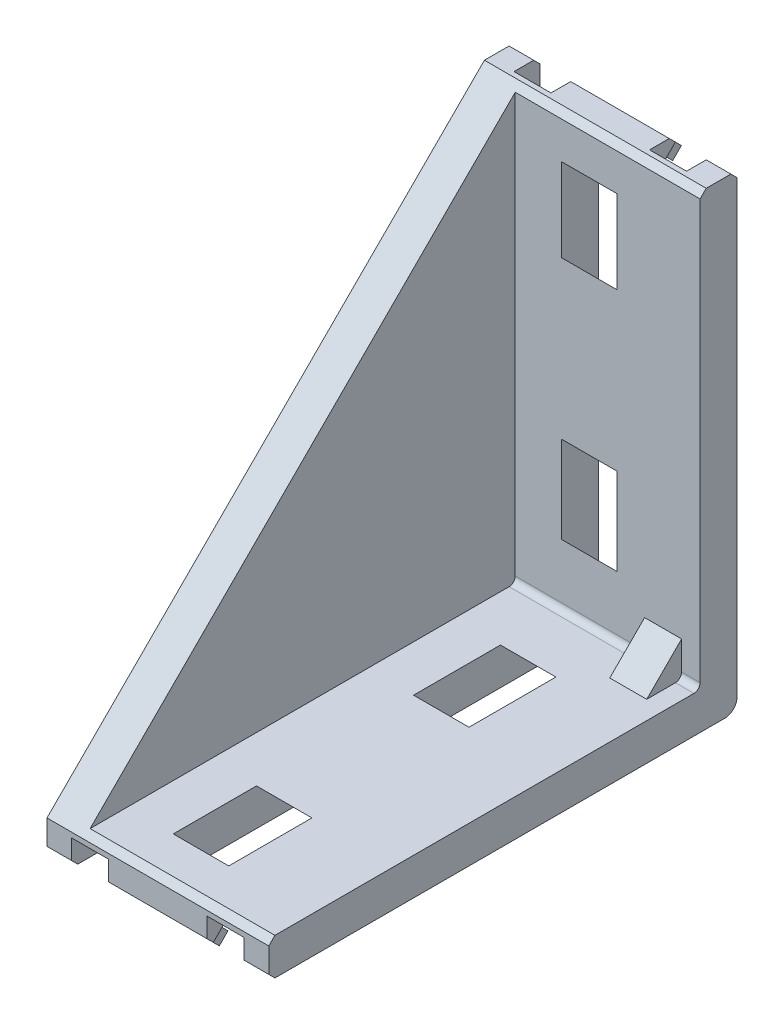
ISO-10303-21;
HEADER;
FILE_DESCRIPTION(('STEP AP214'),'2;1');
FILE_NAME('part.step','',(''),(''),'','','');
FILE_SCHEMA(('AUTOMOTIVE_DESIGN { 1 0 10303 214 1 1 1 1 }'));
ENDSEC;
DATA;
#1=APPLICATION_CONTEXT('core data for automotive mechanical design processes');
#2=APPLICATION_PROTOCOL_DEFINITION('international standard','automotive_design',2000,#1);
#3=PRODUCT_CONTEXT('',#1,'mechanical');
#4=PRODUCT('Part','Part','',(#3));
#5=PRODUCT_RELATED_PRODUCT_CATEGORY('part','',(#4));
#6=PRODUCT_DEFINITION_FORMATION('','',#4);
#7=PRODUCT_DEFINITION_CONTEXT('part definition',#1,'design');
#8=PRODUCT_DEFINITION('design','',#6,#7);
#9=PRODUCT_DEFINITION_SHAPE('','',#8);
#10=(LENGTH_UNIT() NAMED_UNIT(*) SI_UNIT(.MILLI.,.METRE.));
#11=(NAMED_UNIT(*) PLANE_ANGLE_UNIT() SI_UNIT($,.RADIAN.));
#12=(NAMED_UNIT(*) SI_UNIT($,.STERADIAN.) SOLID_ANGLE_UNIT());
#13=UNCERTAINTY_MEASURE_WITH_UNIT(LENGTH_MEASURE(1.E-05),#10,'distance_accuracy_value','');
#14=(GEOMETRIC_REPRESENTATION_CONTEXT(3) GLOBAL_UNCERTAINTY_ASSIGNED_CONTEXT((#13)) GLOBAL_UNIT_ASSIGNED_CONTEXT((#10,
#11,#12)) REPRESENTATION_CONTEXT('',''));
#15=CARTESIAN_POINT('',(0.,0.,0.));
#16=DIRECTION('',(0.,0.,1.));
#17=DIRECTION('',(1.,0.,0.));
#18=AXIS2_PLACEMENT_3D('',#15,#16,#17);
#19=CARTESIAN_POINT('',(-6.,3.49999999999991,3.49999999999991));
#20=DIRECTION('',(-1.,0.,0.));
#21=DIRECTION('',(0.,0.707106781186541,0.707106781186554));
#22=AXIS2_PLACEMENT_3D('',#19,#20,#21);
#23=CYLINDRICAL_SURFACE('',#22,0.499999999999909);
#24=DIRECTION('',(1.,0.,0.));
#25=VECTOR('',#24,1.);
#26=CARTESIAN_POINT('',(-6.,3.49999999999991,3.));
#27=LINE('',#26,#25);
#28=CARTESIAN_POINT('',(7.5,3.4999999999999,3.));
#29=VERTEX_POINT('',#28);
#30=CARTESIAN_POINT('',(9.,3.49999999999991,3.));
#31=VERTEX_POINT('',#30);
#32=EDGE_CURVE('E10',#29,#31,#27,.T.);
#33=ORIENTED_EDGE('',*,*,#32,.F.);
#34=CARTESIAN_POINT('',(7.5,3.49999999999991,3.49999999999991));
#35=DIRECTION('',(-1.,0.,0.));
#36=DIRECTION('',(0.,-1.,0.));
#37=AXIS2_PLACEMENT_3D('',#34,#35,#36);
#38=CIRCLE('',#37,0.499999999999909);
#39=CARTESIAN_POINT('',(7.5,3.,3.49999999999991));
#40=VERTEX_POINT('',#39);
#41=EDGE_CURVE('E24',#29,#40,#38,.T.);
#42=ORIENTED_EDGE('',*,*,#41,.T.);
#43=DIRECTION('',(1.,0.,0.));
#44=VECTOR('',#43,1.);
#45=CARTESIAN_POINT('',(-6.,3.,3.4999999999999));
#46=LINE('',#45,#44);
#47=CARTESIAN_POINT('',(9.,3.,3.4999999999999));
#48=VERTEX_POINT('',#47);
#49=EDGE_CURVE('E1601',#40,#48,#46,.T.);
#50=ORIENTED_EDGE('',*,*,#49,.T.);
#51=CARTESIAN_POINT('',(9.,3.49999999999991,3.49999999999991));
#52=DIRECTION('',(1.,0.,0.));
#53=DIRECTION('',(0.,0.,-1.));
#54=AXIS2_PLACEMENT_3D('',#51,#52,#53);
#55=CIRCLE('',#54,0.499999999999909);
#56=EDGE_CURVE('E1597',#48,#31,#55,.T.);
#57=ORIENTED_EDGE('',*,*,#56,.T.);
#58=EDGE_LOOP('',(#33,#42,#50,#57));
#59=FACE_BOUND('',#58,.T.);
#60=ADVANCED_FACE('F16',(#59),#23,.F.);
#61=CARTESIAN_POINT('',(9.,0.999999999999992,0.999999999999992));
#62=DIRECTION('',(1.,0.,0.));
#63=DIRECTION('',(0.,0.,-1.));
#64=AXIS2_PLACEMENT_3D('',#61,#62,#63);
#65=PLANE('',#64);
#66=DIRECTION('',(0.,0.,-1.));
#67=VECTOR('',#66,1.);
#68=CARTESIAN_POINT('',(9.,3.,37.5));
#69=LINE('',#68,#67);
#70=CARTESIAN_POINT('',(9.,3.,37.5));
#71=VERTEX_POINT('',#70);
#72=EDGE_CURVE('E1592',#71,#48,#69,.T.);
#73=ORIENTED_EDGE('',*,*,#72,.F.);
#74=DIRECTION('',(0.,-0.707106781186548,0.707106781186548));
#75=VECTOR('',#74,1.);
#76=CARTESIAN_POINT('',(9.,38.,2.5));
#77=LINE('',#76,#75);
#78=CARTESIAN_POINT('',(9.,2.5,38.));
#79=VERTEX_POINT('',#78);
#80=EDGE_CURVE('E1588',#71,#79,#77,.T.);
#81=ORIENTED_EDGE('',*,*,#80,.T.);
#82=DIRECTION('',(0.,-1.,0.));
#83=VECTOR('',#82,1.);
#84=CARTESIAN_POINT('',(9.,2.5,38.));
#85=LINE('',#84,#83);
#86=CARTESIAN_POINT('',(9.,0.5,38.));
#87=VERTEX_POINT('',#86);
#88=EDGE_CURVE('E1584',#79,#87,#85,.T.);
#89=ORIENTED_EDGE('',*,*,#88,.T.);
#90=DIRECTION('',(0.,-0.707106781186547,-0.707106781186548));
#91=VECTOR('',#90,1.);
#92=CARTESIAN_POINT('',(9.,0.5,38.));
#93=LINE('',#92,#91);
#94=CARTESIAN_POINT('',(9.,0.,37.5));
#95=VERTEX_POINT('',#94);
#96=EDGE_CURVE('E1580',#87,#95,#93,.T.);
#97=ORIENTED_EDGE('',*,*,#96,.T.);
#98=DIRECTION('',(0.,0.,-1.));
#99=VECTOR('',#98,1.);
#100=CARTESIAN_POINT('',(9.,0.,37.5));
#101=LINE('',#100,#99);
#102=CARTESIAN_POINT('',(9.,0.,0.999999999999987));
#103=VERTEX_POINT('',#102);
#104=EDGE_CURVE('E1576',#95,#103,#101,.T.);
#105=ORIENTED_EDGE('',*,*,#104,.T.);
#106=CARTESIAN_POINT('',(9.,0.999999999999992,0.999999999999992));
#107=DIRECTION('',(1.,0.,0.));
#108=DIRECTION('',(0.,0.,-1.));
#109=AXIS2_PLACEMENT_3D('',#106,#107,#108);
#110=CIRCLE('',#109,0.999999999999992);
#111=CARTESIAN_POINT('',(9.,0.999999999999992,0.));
#112=VERTEX_POINT('',#111);
#113=EDGE_CURVE('E1572',#103,#112,#110,.T.);
#114=ORIENTED_EDGE('',*,*,#113,.T.);
#115=DIRECTION('',(0.,1.,0.));
#116=VECTOR('',#115,1.);
#117=CARTESIAN_POINT('',(9.,0.99999999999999,0.));
#118=LINE('',#117,#116);
#119=CARTESIAN_POINT('',(9.,37.5,0.));
#120=VERTEX_POINT('',#119);
#121=EDGE_CURVE('E1568',#112,#120,#118,.T.);
#122=ORIENTED_EDGE('',*,*,#121,.T.);
#123=DIRECTION('',(0.,0.707106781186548,0.707106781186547));
#124=VECTOR('',#123,1.);
#125=CARTESIAN_POINT('',(9.,37.5,0.));
#126=LINE('',#125,#124);
#127=CARTESIAN_POINT('',(9.,38.,0.5));
#128=VERTEX_POINT('',#127);
#129=EDGE_CURVE('E1564',#120,#128,#126,.T.);
#130=ORIENTED_EDGE('',*,*,#129,.T.);
#131=DIRECTION('',(0.,0.,1.));
#132=VECTOR('',#131,1.);
#133=CARTESIAN_POINT('',(9.,38.,0.5));
#134=LINE('',#133,#132);
#135=CARTESIAN_POINT('',(9.,38.,2.5));
#136=VERTEX_POINT('',#135);
#137=EDGE_CURVE('E1560',#128,#136,#134,.T.);
#138=ORIENTED_EDGE('',*,*,#137,.T.);
#139=DIRECTION('',(0.,-0.707106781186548,0.707106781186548));
#140=VECTOR('',#139,1.);
#141=CARTESIAN_POINT('',(9.,38.,2.5));
#142=LINE('',#141,#140);
#143=CARTESIAN_POINT('',(9.,37.5,3.));
#144=VERTEX_POINT('',#143);
#145=EDGE_CURVE('E1556',#136,#144,#142,.T.);
#146=ORIENTED_EDGE('',*,*,#145,.T.);
#147=DIRECTION('',(0.,1.,0.));
#148=VECTOR('',#147,1.);
#149=CARTESIAN_POINT('',(9.,3.4999999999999,3.));
#150=LINE('',#149,#148);
#151=EDGE_CURVE('E1551',#31,#144,#150,.T.);
#152=ORIENTED_EDGE('',*,*,#151,.F.);
#153=ORIENTED_EDGE('',*,*,#56,.F.);
#154=EDGE_LOOP('',(#73,#81,#89,#97,#105,#114,#122,#130,#138,#146,#152,#153));
#155=FACE_BOUND('',#154,.T.);
#156=ADVANCED_FACE('F1614',(#155),#65,.T.);
#157=CARTESIAN_POINT('',(-6.,3.4999999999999,3.));
#158=DIRECTION('',(0.,0.,-1.));
#159=DIRECTION('',(-1.,0.,0.));
#160=AXIS2_PLACEMENT_3D('',#157,#158,#159);
#161=PLANE('',#160);
#162=DIRECTION('',(1.,0.,0.));
#163=VECTOR('',#162,1.);
#164=CARTESIAN_POINT('',(-2.25,7.9497474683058,3.));
#165=LINE('',#164,#163);
#166=CARTESIAN_POINT('',(-2.25,7.9497474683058,3.));
#167=VERTEX_POINT('',#166);
#168=CARTESIAN_POINT('',(2.25,7.9497474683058,3.));
#169=VERTEX_POINT('',#168);
#170=EDGE_CURVE('E1546',#167,#169,#165,.T.);
#171=ORIENTED_EDGE('',*,*,#170,.F.);
#172=DIRECTION('',(0.,-1.,0.));
#173=VECTOR('',#172,1.);
#174=CARTESIAN_POINT('',(-2.25,15.,3.));
#175=LINE('',#174,#173);
#176=CARTESIAN_POINT('',(-2.25,15.,3.));
#177=VERTEX_POINT('',#176);
#178=EDGE_CURVE('E1541',#177,#167,#175,.T.);
#179=ORIENTED_EDGE('',*,*,#178,.F.);
#180=DIRECTION('',(1.,0.,0.));
#181=VECTOR('',#180,1.);
#182=CARTESIAN_POINT('',(-2.25,15.,3.));
#183=LINE('',#182,#181);
#184=CARTESIAN_POINT('',(2.25,15.,3.));
#185=VERTEX_POINT('',#184);
#186=EDGE_CURVE('E1537',#177,#185,#183,.T.);
#187=ORIENTED_EDGE('',*,*,#186,.T.);
#188=DIRECTION('',(0.,-1.,0.));
#189=VECTOR('',#188,1.);
#190=CARTESIAN_POINT('',(2.25,15.,3.));
#191=LINE('',#190,#189);
#192=EDGE_CURVE('E1533',#185,#169,#191,.T.);
#193=ORIENTED_EDGE('',*,*,#192,.T.);
#194=EDGE_LOOP('',(#171,#179,#187,#193));
#195=FACE_BOUND('',#194,.T.);
#196=DIRECTION('',(1.,0.,0.));
#197=VECTOR('',#196,1.);
#198=CARTESIAN_POINT('',(-2.25,27.748737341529,3.));
#199=LINE('',#198,#197);
#200=CARTESIAN_POINT('',(-2.25,27.748737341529,3.));
#201=VERTEX_POINT('',#200);
#202=CARTESIAN_POINT('',(2.25,27.748737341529,3.));
#203=VERTEX_POINT('',#202);
#204=EDGE_CURVE('E1528',#201,#203,#199,.T.);
#205=ORIENTED_EDGE('',*,*,#204,.F.);
#206=DIRECTION('',(0.,-1.,0.));
#207=VECTOR('',#206,1.);
#208=CARTESIAN_POINT('',(-2.25,34.5,3.));
#209=LINE('',#208,#207);
#210=CARTESIAN_POINT('',(-2.25,34.5,3.));
#211=VERTEX_POINT('',#210);
#212=EDGE_CURVE('E1523',#211,#201,#209,.T.);
#213=ORIENTED_EDGE('',*,*,#212,.F.);
#214=DIRECTION('',(1.,0.,0.));
#215=VECTOR('',#214,1.);
#216=CARTESIAN_POINT('',(-2.25,34.5,3.));
#217=LINE('',#216,#215);
#218=CARTESIAN_POINT('',(2.25,34.5,3.));
#219=VERTEX_POINT('',#218);
#220=EDGE_CURVE('E1519',#211,#219,#217,.T.);
#221=ORIENTED_EDGE('',*,*,#220,.T.);
#222=DIRECTION('',(0.,-1.,0.));
#223=VECTOR('',#222,1.);
#224=CARTESIAN_POINT('',(2.25,34.5,3.));
#225=LINE('',#224,#223);
#226=EDGE_CURVE('E1515',#219,#203,#225,.T.);
#227=ORIENTED_EDGE('',*,*,#226,.T.);
#228=EDGE_LOOP('',(#205,#213,#221,#227));
#229=FACE_BOUND('',#228,.T.);
#230=DIRECTION('',(0.,-1.,0.));
#231=VECTOR('',#230,1.);
#232=CARTESIAN_POINT('',(7.5,5.8284271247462,3.));
#233=LINE('',#232,#231);
#234=CARTESIAN_POINT('',(7.5,5.8284271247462,3.));
#235=VERTEX_POINT('',#234);
#236=EDGE_CURVE('E1511',#235,#29,#233,.T.);
#237=ORIENTED_EDGE('',*,*,#236,.T.);
#238=ORIENTED_EDGE('',*,*,#32,.T.);
#239=ORIENTED_EDGE('',*,*,#151,.T.);
#240=DIRECTION('',(1.,0.,0.));
#241=VECTOR('',#240,1.);
#242=CARTESIAN_POINT('',(-6.,37.5,3.));
#243=LINE('',#242,#241);
#244=CARTESIAN_POINT('',(-6.,37.5,3.));
#245=VERTEX_POINT('',#244);
#246=EDGE_CURVE('E1506',#245,#144,#243,.T.);
#247=ORIENTED_EDGE('',*,*,#246,.F.);
#248=DIRECTION('',(0.,1.,0.));
#249=VECTOR('',#248,1.);
#250=CARTESIAN_POINT('',(-6.,3.4999999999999,3.));
#251=LINE('',#250,#249);
#252=CARTESIAN_POINT('',(-6.,3.49999999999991,3.));
#253=VERTEX_POINT('',#252);
#254=EDGE_CURVE('E1501',#253,#245,#251,.T.);
#255=ORIENTED_EDGE('',*,*,#254,.F.);
#256=DIRECTION('',(1.,0.,0.));
#257=VECTOR('',#256,1.);
#258=CARTESIAN_POINT('',(-6.,3.49999999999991,3.));
#259=LINE('',#258,#257);
#260=CARTESIAN_POINT('',(4.5,3.4999999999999,3.));
#261=VERTEX_POINT('',#260);
#262=EDGE_CURVE('E1497',#253,#261,#259,.T.);
#263=ORIENTED_EDGE('',*,*,#262,.T.);
#264=DIRECTION('',(0.,-1.,0.));
#265=VECTOR('',#264,1.);
#266=CARTESIAN_POINT('',(4.5,5.8284271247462,3.));
#267=LINE('',#266,#265);
#268=CARTESIAN_POINT('',(4.5,5.8284271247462,3.));
#269=VERTEX_POINT('',#268);
#270=EDGE_CURVE('E1492',#269,#261,#267,.T.);
#271=ORIENTED_EDGE('',*,*,#270,.F.);
#272=DIRECTION('',(-1.,0.,0.));
#273=VECTOR('',#272,1.);
#274=CARTESIAN_POINT('',(7.5,5.8284271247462,3.));
#275=LINE('',#274,#273);
#276=EDGE_CURVE('E1487',#235,#269,#275,.T.);
#277=ORIENTED_EDGE('',*,*,#276,.F.);
#278=EDGE_LOOP('',(#237,#238,#239,#247,#255,#263,#271,#277));
#279=FACE_BOUND('',#278,.T.);
#280=ADVANCED_FACE('F1657',(#195,#229,#279),#161,.F.);
#281=CARTESIAN_POINT('',(7.5,3.,5.8284271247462));
#282=DIRECTION('',(0.,0.707106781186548,0.707106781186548));
#283=DIRECTION('',(0.,-0.707106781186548,0.707106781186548));
#284=AXIS2_PLACEMENT_3D('',#281,#282,#283);
#285=PLANE('',#284);
#286=DIRECTION('',(0.,0.707106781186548,-0.707106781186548));
#287=VECTOR('',#286,1.);
#288=CARTESIAN_POINT('',(4.5,3.,5.8284271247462));
#289=LINE('',#288,#287);
#290=CARTESIAN_POINT('',(4.5,3.,5.8284271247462));
#291=VERTEX_POINT('',#290);
#292=EDGE_CURVE('E1482',#291,#269,#289,.T.);
#293=ORIENTED_EDGE('',*,*,#292,.F.);
#294=DIRECTION('',(-1.,0.,0.));
#295=VECTOR('',#294,1.);
#296=CARTESIAN_POINT('',(7.5,3.,5.8284271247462));
#297=LINE('',#296,#295);
#298=CARTESIAN_POINT('',(7.5,3.,5.8284271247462));
#299=VERTEX_POINT('',#298);
#300=EDGE_CURVE('E1477',#299,#291,#297,.T.);
#301=ORIENTED_EDGE('',*,*,#300,.F.);
#302=DIRECTION('',(0.,0.707106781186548,-0.707106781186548));
#303=VECTOR('',#302,1.);
#304=CARTESIAN_POINT('',(7.5,3.,5.8284271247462));
#305=LINE('',#304,#303);
#306=EDGE_CURVE('E1472',#299,#235,#305,.T.);
#307=ORIENTED_EDGE('',*,*,#306,.T.);
#308=ORIENTED_EDGE('',*,*,#276,.T.);
#309=EDGE_LOOP('',(#293,#301,#307,#308));
#310=FACE_BOUND('',#309,.T.);
#311=ADVANCED_FACE('F1672',(#310),#285,.T.);
#312=CARTESIAN_POINT('',(7.5,3.49999999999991,3.49999999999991));
#313=DIRECTION('',(-1.,0.,0.));
#314=DIRECTION('',(0.,0.,1.));
#315=AXIS2_PLACEMENT_3D('',#312,#313,#314);
#316=PLANE('',#315);
#317=ORIENTED_EDGE('',*,*,#306,.F.);
#318=DIRECTION('',(0.,0.,1.));
#319=VECTOR('',#318,1.);
#320=CARTESIAN_POINT('',(7.5,3.,3.4999999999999));
#321=LINE('',#320,#319);
#322=EDGE_CURVE('E1467',#40,#299,#321,.T.);
#323=ORIENTED_EDGE('',*,*,#322,.F.);
#324=ORIENTED_EDGE('',*,*,#41,.F.);
#325=ORIENTED_EDGE('',*,*,#236,.F.);
#326=EDGE_LOOP('',(#317,#323,#324,#325));
#327=FACE_BOUND('',#326,.T.);
#328=ADVANCED_FACE('F1661',(#327),#316,.F.);
#329=CARTESIAN_POINT('',(-6.,3.,37.5));
#330=DIRECTION('',(0.,-1.,0.));
#331=DIRECTION('',(0.,0.,-1.));
#332=AXIS2_PLACEMENT_3D('',#329,#330,#331);
#333=PLANE('',#332);
#334=DIRECTION('',(0.,0.,1.));
#335=VECTOR('',#334,1.);
#336=CARTESIAN_POINT('',(-2.25,3.,7.9497474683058));
#337=LINE('',#336,#335);
#338=CARTESIAN_POINT('',(-2.25,3.,7.9497474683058));
#339=VERTEX_POINT('',#338);
#340=CARTESIAN_POINT('',(-2.25,3.,15.));
#341=VERTEX_POINT('',#340);
#342=EDGE_CURVE('E1462',#339,#341,#337,.T.);
#343=ORIENTED_EDGE('',*,*,#342,.F.);
#344=DIRECTION('',(1.,0.,0.));
#345=VECTOR('',#344,1.);
#346=CARTESIAN_POINT('',(-2.25,3.,7.9497474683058));
#347=LINE('',#346,#345);
#348=CARTESIAN_POINT('',(2.25,3.,7.9497474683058));
#349=VERTEX_POINT('',#348);
#350=EDGE_CURVE('E1458',#339,#349,#347,.T.);
#351=ORIENTED_EDGE('',*,*,#350,.T.);
#352=DIRECTION('',(0.,0.,1.));
#353=VECTOR('',#352,1.);
#354=CARTESIAN_POINT('',(2.25,3.,7.9497474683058));
#355=LINE('',#354,#353);
#356=CARTESIAN_POINT('',(2.25,3.,15.));
#357=VERTEX_POINT('',#356);
#358=EDGE_CURVE('E1454',#349,#357,#355,.T.);
#359=ORIENTED_EDGE('',*,*,#358,.T.);
#360=DIRECTION('',(1.,0.,0.));
#361=VECTOR('',#360,1.);
#362=CARTESIAN_POINT('',(-2.25,3.,15.));
#363=LINE('',#362,#361);
#364=EDGE_CURVE('E1449',#341,#357,#363,.T.);
#365=ORIENTED_EDGE('',*,*,#364,.F.);
#366=EDGE_LOOP('',(#343,#351,#359,#365));
#367=FACE_BOUND('',#366,.T.);
#368=ORIENTED_EDGE('',*,*,#322,.T.);
#369=ORIENTED_EDGE('',*,*,#300,.T.);
#370=DIRECTION('',(0.,0.,1.));
#371=VECTOR('',#370,1.);
#372=CARTESIAN_POINT('',(4.5,3.,3.4999999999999));
#373=LINE('',#372,#371);
#374=CARTESIAN_POINT('',(4.5,3.,3.49999999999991));
#375=VERTEX_POINT('',#374);
#376=EDGE_CURVE('E1444',#375,#291,#373,.T.);
#377=ORIENTED_EDGE('',*,*,#376,.F.);
#378=DIRECTION('',(1.,0.,0.));
#379=VECTOR('',#378,1.);
#380=CARTESIAN_POINT('',(-6.,3.,3.4999999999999));
#381=LINE('',#380,#379);
#382=CARTESIAN_POINT('',(-6.,3.,3.4999999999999));
#383=VERTEX_POINT('',#382);
#384=EDGE_CURVE('E1439',#383,#375,#381,.T.);
#385=ORIENTED_EDGE('',*,*,#384,.F.);
#386=DIRECTION('',(0.,0.,-1.));
#387=VECTOR('',#386,1.);
#388=CARTESIAN_POINT('',(-6.,3.,37.5));
#389=LINE('',#388,#387);
#390=CARTESIAN_POINT('',(-6.,3.,37.5));
#391=VERTEX_POINT('',#390);
#392=EDGE_CURVE('E1434',#391,#383,#389,.T.);
#393=ORIENTED_EDGE('',*,*,#392,.F.);
#394=DIRECTION('',(1.,0.,0.));
#395=VECTOR('',#394,1.);
#396=CARTESIAN_POINT('',(-6.,3.,37.5));
#397=LINE('',#396,#395);
#398=EDGE_CURVE('E1429',#391,#71,#397,.T.);
#399=ORIENTED_EDGE('',*,*,#398,.T.);
#400=ORIENTED_EDGE('',*,*,#72,.T.);
#401=ORIENTED_EDGE('',*,*,#49,.F.);
#402=EDGE_LOOP('',(#368,#369,#377,#385,#393,#399,#400,#401));
#403=FACE_BOUND('',#402,.T.);
#404=DIRECTION('',(0.,0.,1.));
#405=VECTOR('',#404,1.);
#406=CARTESIAN_POINT('',(-2.25,3.,27.748737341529));
#407=LINE('',#406,#405);
#408=CARTESIAN_POINT('',(-2.25,3.,27.748737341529));
#409=VERTEX_POINT('',#408);
#410=CARTESIAN_POINT('',(-2.25,3.,34.5));
#411=VERTEX_POINT('',#410);
#412=EDGE_CURVE('E1424',#409,#411,#407,.T.);
#413=ORIENTED_EDGE('',*,*,#412,.F.);
#414=DIRECTION('',(1.,0.,0.));
#415=VECTOR('',#414,1.);
#416=CARTESIAN_POINT('',(-2.25,3.,27.748737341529));
#417=LINE('',#416,#415);
#418=CARTESIAN_POINT('',(2.25,3.,27.748737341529));
#419=VERTEX_POINT('',#418);
#420=EDGE_CURVE('E1420',#409,#419,#417,.T.);
#421=ORIENTED_EDGE('',*,*,#420,.T.);
#422=DIRECTION('',(0.,0.,1.));
#423=VECTOR('',#422,1.);
#424=CARTESIAN_POINT('',(2.25,3.,27.748737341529));
#425=LINE('',#424,#423);
#426=CARTESIAN_POINT('',(2.25,3.,34.5));
#427=VERTEX_POINT('',#426);
#428=EDGE_CURVE('E1416',#419,#427,#425,.T.);
#429=ORIENTED_EDGE('',*,*,#428,.T.);
#430=DIRECTION('',(1.,0.,0.));
#431=VECTOR('',#430,1.);
#432=CARTESIAN_POINT('',(-2.25,3.,34.5));
#433=LINE('',#432,#431);
#434=EDGE_CURVE('E1411',#411,#427,#433,.T.);
#435=ORIENTED_EDGE('',*,*,#434,.F.);
#436=EDGE_LOOP('',(#413,#421,#429,#435));
#437=FACE_BOUND('',#436,.T.);
#438=ADVANCED_FACE('F1615',(#367,#403,#437),#333,.F.);
#439=CARTESIAN_POINT('',(-2.25,3.,34.5));
#440=DIRECTION('',(0.,0.,1.));
#441=DIRECTION('',(1.,0.,0.));
#442=AXIS2_PLACEMENT_3D('',#439,#440,#441);
#443=PLANE('',#442);
#444=DIRECTION('',(0.,-1.,0.));
#445=VECTOR('',#444,1.);
#446=CARTESIAN_POINT('',(2.25,3.,34.5));
#447=LINE('',#446,#445);
#448=CARTESIAN_POINT('',(2.25,0.,34.5));
#449=VERTEX_POINT('',#448);
#450=EDGE_CURVE('E1407',#427,#449,#447,.T.);
#451=ORIENTED_EDGE('',*,*,#450,.T.);
#452=DIRECTION('',(1.,0.,0.));
#453=VECTOR('',#452,1.);
#454=CARTESIAN_POINT('',(-2.25,0.,34.5));
#455=LINE('',#454,#453);
#456=CARTESIAN_POINT('',(-2.25,0.,34.5));
#457=VERTEX_POINT('',#456);
#458=EDGE_CURVE('E1402',#457,#449,#455,.T.);
#459=ORIENTED_EDGE('',*,*,#458,.F.);
#460=DIRECTION('',(0.,-1.,0.));
#461=VECTOR('',#460,1.);
#462=CARTESIAN_POINT('',(-2.25,3.,34.5));
#463=LINE('',#462,#461);
#464=EDGE_CURVE('E1397',#411,#457,#463,.T.);
#465=ORIENTED_EDGE('',*,*,#464,.F.);
#466=ORIENTED_EDGE('',*,*,#434,.T.);
#467=EDGE_LOOP('',(#451,#459,#465,#466));
#468=FACE_BOUND('',#467,.T.);
#469=ADVANCED_FACE('F1716',(#468),#443,.F.);
#470=CARTESIAN_POINT('',(-2.25,0.,0.));
#471=DIRECTION('',(1.,0.,0.));
#472=DIRECTION('',(0.,0.,-1.));
#473=AXIS2_PLACEMENT_3D('',#470,#471,#472);
#474=PLANE('',#473);
#475=ORIENTED_EDGE('',*,*,#464,.T.);
#476=DIRECTION('',(0.,0.,-1.));
#477=VECTOR('',#476,1.);
#478=CARTESIAN_POINT('',(-2.25,0.,34.5));
#479=LINE('',#478,#477);
#480=CARTESIAN_POINT('',(-2.25,0.,24.748737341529));
#481=VERTEX_POINT('',#480);
#482=EDGE_CURVE('E1393',#457,#481,#479,.T.);
#483=ORIENTED_EDGE('',*,*,#482,.T.);
#484=DIRECTION('',(0.,0.707106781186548,0.707106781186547));
#485=VECTOR('',#484,1.);
#486=CARTESIAN_POINT('',(-2.25,0.,24.748737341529));
#487=LINE('',#486,#485);
#488=EDGE_CURVE('E1388',#481,#409,#487,.T.);
#489=ORIENTED_EDGE('',*,*,#488,.T.);
#490=ORIENTED_EDGE('',*,*,#412,.T.);
#491=EDGE_LOOP('',(#475,#483,#489,#490));
#492=FACE_BOUND('',#491,.T.);
#493=ADVANCED_FACE('F1726',(#492),#474,.T.);
#494=CARTESIAN_POINT('',(-2.25,0.,24.748737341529));
#495=DIRECTION('',(0.,0.707106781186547,-0.707106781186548));
#496=DIRECTION('',(0.,0.707106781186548,0.707106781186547));
#497=AXIS2_PLACEMENT_3D('',#494,#495,#496);
#498=PLANE('',#497);
#499=DIRECTION('',(0.,0.707106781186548,0.707106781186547));
#500=VECTOR('',#499,1.);
#501=CARTESIAN_POINT('',(2.25,0.,24.748737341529));
#502=LINE('',#501,#500);
#503=CARTESIAN_POINT('',(2.25,0.,24.748737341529));
#504=VERTEX_POINT('',#503);
#505=EDGE_CURVE('E1383',#504,#419,#502,.T.);
#506=ORIENTED_EDGE('',*,*,#505,.T.);
#507=ORIENTED_EDGE('',*,*,#420,.F.);
#508=ORIENTED_EDGE('',*,*,#488,.F.);
#509=DIRECTION('',(1.,0.,0.));
#510=VECTOR('',#509,1.);
#511=CARTESIAN_POINT('',(-2.25,0.,24.748737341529));
#512=LINE('',#511,#510);
#513=EDGE_CURVE('E1379',#481,#504,#512,.T.);
#514=ORIENTED_EDGE('',*,*,#513,.T.);
#515=EDGE_LOOP('',(#506,#507,#508,#514));
#516=FACE_BOUND('',#515,.T.);
#517=ADVANCED_FACE('F1736',(#516),#498,.F.);
#518=CARTESIAN_POINT('',(-9.,0.,37.5));
#519=DIRECTION('',(0.,-1.,0.));
#520=DIRECTION('',(0.,0.,-1.));
#521=AXIS2_PLACEMENT_3D('',#518,#519,#520);
#522=PLANE('',#521);
#523=DIRECTION('',(1.,0.,0.));
#524=VECTOR('',#523,1.);
#525=CARTESIAN_POINT('',(-9.,0.,0.999999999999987));
#526=LINE('',#525,#524);
#527=CARTESIAN_POINT('',(-9.,0.,0.999999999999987));
#528=VERTEX_POINT('',#527);
#529=CARTESIAN_POINT('',(-4.,0.,0.99999999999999));
#530=VERTEX_POINT('',#529);
#531=EDGE_CURVE('E1375',#528,#530,#526,.T.);
#532=ORIENTED_EDGE('',*,*,#531,.T.);
#533=DIRECTION('',(0.,0.,-1.));
#534=VECTOR('',#533,1.);
#535=CARTESIAN_POINT('',(-4.,0.,3.6769552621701));
#536=LINE('',#535,#534);
#537=CARTESIAN_POINT('',(-4.,0.,3.6769552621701));
#538=VERTEX_POINT('',#537);
#539=EDGE_CURVE('E1370',#538,#530,#536,.T.);
#540=ORIENTED_EDGE('',*,*,#539,.F.);
#541=DIRECTION('',(1.,0.,0.));
#542=VECTOR('',#541,1.);
#543=CARTESIAN_POINT('',(-4.,0.,3.6769552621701));
#544=LINE('',#543,#542);
#545=CARTESIAN_POINT('',(4.,0.,3.6769552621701));
#546=VERTEX_POINT('',#545);
#547=EDGE_CURVE('E1366',#538,#546,#544,.T.);
#548=ORIENTED_EDGE('',*,*,#547,.T.);
#549=DIRECTION('',(0.,0.,-1.));
#550=VECTOR('',#549,1.);
#551=CARTESIAN_POINT('',(4.,0.,3.6769552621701));
#552=LINE('',#551,#550);
#553=CARTESIAN_POINT('',(4.,0.,0.99999999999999));
#554=VERTEX_POINT('',#553);
#555=EDGE_CURVE('E1362',#546,#554,#552,.T.);
#556=ORIENTED_EDGE('',*,*,#555,.T.);
#557=DIRECTION('',(1.,0.,0.));
#558=VECTOR('',#557,1.);
#559=CARTESIAN_POINT('',(-9.,0.,0.999999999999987));
#560=LINE('',#559,#558);
#561=EDGE_CURVE('E1357',#554,#103,#560,.T.);
#562=ORIENTED_EDGE('',*,*,#561,.T.);
#563=ORIENTED_EDGE('',*,*,#104,.F.);
#564=DIRECTION('',(1.,0.,0.));
#565=VECTOR('',#564,1.);
#566=CARTESIAN_POINT('',(-9.,0.,37.5));
#567=LINE('',#566,#565);
#568=CARTESIAN_POINT('',(7.,0.,37.5));
#569=VERTEX_POINT('',#568);
#570=EDGE_CURVE('E1352',#569,#95,#567,.T.);
#571=ORIENTED_EDGE('',*,*,#570,.F.);
#572=DIRECTION('',(0.,0.,1.));
#573=VECTOR('',#572,1.);
#574=CARTESIAN_POINT('',(7.,0.,35.5));
#575=LINE('',#574,#573);
#576=CARTESIAN_POINT('',(7.,0.,35.5));
#577=VERTEX_POINT('',#576);
#578=EDGE_CURVE('E1347',#577,#569,#575,.T.);
#579=ORIENTED_EDGE('',*,*,#578,.F.);
#580=DIRECTION('',(-1.,0.,0.));
#581=VECTOR('',#580,1.);
#582=CARTESIAN_POINT('',(7.,0.,35.5));
#583=LINE('',#582,#581);
#584=CARTESIAN_POINT('',(4.,0.,35.5));
#585=VERTEX_POINT('',#584);
#586=EDGE_CURVE('E1343',#577,#585,#583,.T.);
#587=ORIENTED_EDGE('',*,*,#586,.T.);
#588=DIRECTION('',(0.,0.,-1.));
#589=VECTOR('',#588,1.);
#590=CARTESIAN_POINT('',(4.,0.,37.5));
#591=LINE('',#590,#589);
#592=CARTESIAN_POINT('',(4.,0.,34.671572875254));
#593=VERTEX_POINT('',#592);
#594=EDGE_CURVE('E1339',#585,#593,#591,.T.);
#595=ORIENTED_EDGE('',*,*,#594,.T.);
#596=DIRECTION('',(1.,0.,0.));
#597=VECTOR('',#596,1.);
#598=CARTESIAN_POINT('',(-4.,0.,34.671572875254));
#599=LINE('',#598,#597);
#600=CARTESIAN_POINT('',(-4.,0.,34.671572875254));
#601=VERTEX_POINT('',#600);
#602=EDGE_CURVE('E1334',#601,#593,#599,.T.);
#603=ORIENTED_EDGE('',*,*,#602,.F.);
#604=DIRECTION('',(0.,0.,-1.));
#605=VECTOR('',#604,1.);
#606=CARTESIAN_POINT('',(-4.,0.,37.5));
#607=LINE('',#606,#605);
#608=CARTESIAN_POINT('',(-4.,0.,35.5));
#609=VERTEX_POINT('',#608);
#610=EDGE_CURVE('E1329',#609,#601,#607,.T.);
#611=ORIENTED_EDGE('',*,*,#610,.F.);
#612=DIRECTION('',(1.,0.,0.));
#613=VECTOR('',#612,1.);
#614=CARTESIAN_POINT('',(-7.,0.,35.5));
#615=LINE('',#614,#613);
#616=CARTESIAN_POINT('',(-7.,0.,35.5));
#617=VERTEX_POINT('',#616);
#618=EDGE_CURVE('E1324',#617,#609,#615,.T.);
#619=ORIENTED_EDGE('',*,*,#618,.F.);
#620=DIRECTION('',(0.,0.,-1.));
#621=VECTOR('',#620,1.);
#622=CARTESIAN_POINT('',(-7.,0.,37.5));
#623=LINE('',#622,#621);
#624=CARTESIAN_POINT('',(-7.,0.,37.5));
#625=VERTEX_POINT('',#624);
#626=EDGE_CURVE('E1319',#625,#617,#623,.T.);
#627=ORIENTED_EDGE('',*,*,#626,.F.);
#628=DIRECTION('',(1.,0.,0.));
#629=VECTOR('',#628,1.);
#630=CARTESIAN_POINT('',(-9.,0.,37.5));
#631=LINE('',#630,#629);
#632=CARTESIAN_POINT('',(-9.,0.,37.5));
#633=VERTEX_POINT('',#632);
#634=EDGE_CURVE('E1314',#633,#625,#631,.T.);
#635=ORIENTED_EDGE('',*,*,#634,.F.);
#636=DIRECTION('',(0.,0.,-1.));
#637=VECTOR('',#636,1.);
#638=CARTESIAN_POINT('',(-9.,0.,37.5));
#639=LINE('',#638,#637);
#640=EDGE_CURVE('E1310',#633,#528,#639,.T.);
#641=ORIENTED_EDGE('',*,*,#640,.T.);
#642=EDGE_LOOP('',(#532,#540,#548,#556,#562,#563,#571,#579,#587,#595,#603,#611,#619,#627,#635,#641));
#643=FACE_BOUND('',#642,.T.);
#644=DIRECTION('',(1.,0.,0.));
#645=VECTOR('',#644,1.);
#646=CARTESIAN_POINT('',(-2.25,0.,4.9497474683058));
#647=LINE('',#646,#645);
#648=CARTESIAN_POINT('',(-2.25,0.,4.9497474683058));
#649=VERTEX_POINT('',#648);
#650=CARTESIAN_POINT('',(2.25,0.,4.9497474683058));
#651=VERTEX_POINT('',#650);
#652=EDGE_CURVE('E1305',#649,#651,#647,.T.);
#653=ORIENTED_EDGE('',*,*,#652,.F.);
#654=DIRECTION('',(0.,0.,-1.));
#655=VECTOR('',#654,1.);
#656=CARTESIAN_POINT('',(-2.25,0.,15.));
#657=LINE('',#656,#655);
#658=CARTESIAN_POINT('',(-2.25,0.,15.));
#659=VERTEX_POINT('',#658);
#660=EDGE_CURVE('E1300',#659,#649,#657,.T.);
#661=ORIENTED_EDGE('',*,*,#660,.F.);
#662=DIRECTION('',(1.,0.,0.));
#663=VECTOR('',#662,1.);
#664=CARTESIAN_POINT('',(-2.25,0.,15.));
#665=LINE('',#664,#663);
#666=CARTESIAN_POINT('',(2.25,0.,15.));
#667=VERTEX_POINT('',#666);
#668=EDGE_CURVE('E1296',#659,#667,#665,.T.);
#669=ORIENTED_EDGE('',*,*,#668,.T.);
#670=DIRECTION('',(0.,0.,-1.));
#671=VECTOR('',#670,1.);
#672=CARTESIAN_POINT('',(2.25,0.,15.));
#673=LINE('',#672,#671);
#674=EDGE_CURVE('E1292',#667,#651,#673,.T.);
#675=ORIENTED_EDGE('',*,*,#674,.T.);
#676=EDGE_LOOP('',(#653,#661,#669,#675));
#677=FACE_BOUND('',#676,.T.);
#678=ORIENTED_EDGE('',*,*,#513,.F.);
#679=ORIENTED_EDGE('',*,*,#482,.F.);
#680=ORIENTED_EDGE('',*,*,#458,.T.);
#681=DIRECTION('',(0.,0.,-1.));
#682=VECTOR('',#681,1.);
#683=CARTESIAN_POINT('',(2.25,0.,34.5));
#684=LINE('',#683,#682);
#685=EDGE_CURVE('E1287',#449,#504,#684,.T.);
#686=ORIENTED_EDGE('',*,*,#685,.T.);
#687=EDGE_LOOP('',(#678,#679,#680,#686));
#688=FACE_BOUND('',#687,.T.);
#689=ADVANCED_FACE('F1633',(#643,#677,#688),#522,.T.);
#690=CARTESIAN_POINT('',(2.25,0.,0.));
#691=DIRECTION('',(1.,0.,0.));
#692=DIRECTION('',(0.,0.,-1.));
#693=AXIS2_PLACEMENT_3D('',#690,#691,#692);
#694=PLANE('',#693);
#695=ORIENTED_EDGE('',*,*,#450,.F.);
#696=ORIENTED_EDGE('',*,*,#428,.F.);
#697=ORIENTED_EDGE('',*,*,#505,.F.);
#698=ORIENTED_EDGE('',*,*,#685,.F.);
#699=EDGE_LOOP('',(#695,#696,#697,#698));
#700=FACE_BOUND('',#699,.T.);
#701=ADVANCED_FACE('F1755',(#700),#694,.F.);
#702=CARTESIAN_POINT('',(2.25,0.,0.));
#703=DIRECTION('',(1.,0.,0.));
#704=DIRECTION('',(0.,0.,-1.));
#705=AXIS2_PLACEMENT_3D('',#702,#703,#704);
#706=PLANE('',#705);
#707=DIRECTION('',(0.,-1.,0.));
#708=VECTOR('',#707,1.);
#709=CARTESIAN_POINT('',(2.25,3.,15.));
#710=LINE('',#709,#708);
#711=EDGE_CURVE('E1282',#357,#667,#710,.T.);
#712=ORIENTED_EDGE('',*,*,#711,.F.);
#713=ORIENTED_EDGE('',*,*,#358,.F.);
#714=DIRECTION('',(0.,0.707106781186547,0.707106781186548));
#715=VECTOR('',#714,1.);
#716=CARTESIAN_POINT('',(2.25,0.,4.9497474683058));
#717=LINE('',#716,#715);
#718=EDGE_CURVE('E1277',#651,#349,#717,.T.);
#719=ORIENTED_EDGE('',*,*,#718,.F.);
#720=ORIENTED_EDGE('',*,*,#674,.F.);
#721=EDGE_LOOP('',(#712,#713,#719,#720));
#722=FACE_BOUND('',#721,.T.);
#723=ADVANCED_FACE('F1764',(#722),#706,.F.);
#724=CARTESIAN_POINT('',(-2.25,0.,4.9497474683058));
#725=DIRECTION('',(0.,0.707106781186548,-0.707106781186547));
#726=DIRECTION('',(0.,0.707106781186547,0.707106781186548));
#727=AXIS2_PLACEMENT_3D('',#724,#725,#726);
#728=PLANE('',#727);
#729=ORIENTED_EDGE('',*,*,#718,.T.);
#730=ORIENTED_EDGE('',*,*,#350,.F.);
#731=DIRECTION('',(0.,0.707106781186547,0.707106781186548));
#732=VECTOR('',#731,1.);
#733=CARTESIAN_POINT('',(-2.25,0.,4.9497474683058));
#734=LINE('',#733,#732);
#735=EDGE_CURVE('E1272',#649,#339,#734,.T.);
#736=ORIENTED_EDGE('',*,*,#735,.F.);
#737=ORIENTED_EDGE('',*,*,#652,.T.);
#738=EDGE_LOOP('',(#729,#730,#736,#737));
#739=FACE_BOUND('',#738,.T.);
#740=ADVANCED_FACE('F1774',(#739),#728,.F.);
#741=CARTESIAN_POINT('',(-2.25,0.,0.));
#742=DIRECTION('',(1.,0.,0.));
#743=DIRECTION('',(0.,0.,-1.));
#744=AXIS2_PLACEMENT_3D('',#741,#742,#743);
#745=PLANE('',#744);
#746=DIRECTION('',(0.,-1.,0.));
#747=VECTOR('',#746,1.);
#748=CARTESIAN_POINT('',(-2.25,3.,15.));
#749=LINE('',#748,#747);
#750=EDGE_CURVE('E1267',#341,#659,#749,.T.);
#751=ORIENTED_EDGE('',*,*,#750,.T.);
#752=ORIENTED_EDGE('',*,*,#660,.T.);
#753=ORIENTED_EDGE('',*,*,#735,.T.);
#754=ORIENTED_EDGE('',*,*,#342,.T.);
#755=EDGE_LOOP('',(#751,#752,#753,#754));
#756=FACE_BOUND('',#755,.T.);
#757=ADVANCED_FACE('F1784',(#756),#745,.T.);
#758=CARTESIAN_POINT('',(-2.25,3.,15.));
#759=DIRECTION('',(0.,0.,1.));
#760=DIRECTION('',(1.,0.,0.));
#761=AXIS2_PLACEMENT_3D('',#758,#759,#760);
#762=PLANE('',#761);
#763=ORIENTED_EDGE('',*,*,#711,.T.);
#764=ORIENTED_EDGE('',*,*,#668,.F.);
#765=ORIENTED_EDGE('',*,*,#750,.F.);
#766=ORIENTED_EDGE('',*,*,#364,.T.);
#767=EDGE_LOOP('',(#763,#764,#765,#766));
#768=FACE_BOUND('',#767,.T.);
#769=ADVANCED_FACE('F1794',(#768),#762,.F.);
#770=CARTESIAN_POINT('',(-9.,0.999999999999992,0.999999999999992));
#771=DIRECTION('',(1.,0.,0.));
#772=DIRECTION('',(0.,0.,-1.));
#773=AXIS2_PLACEMENT_3D('',#770,#771,#772);
#774=PLANE('',#773);
#775=DIRECTION('',(0.,-1.,0.));
#776=VECTOR('',#775,1.);
#777=CARTESIAN_POINT('',(-9.,2.5,38.));
#778=LINE('',#777,#776);
#779=CARTESIAN_POINT('',(-9.,2.5,38.));
#780=VERTEX_POINT('',#779);
#781=CARTESIAN_POINT('',(-9.,0.5,38.));
#782=VERTEX_POINT('',#781);
#783=EDGE_CURVE('E1262',#780,#782,#778,.T.);
#784=ORIENTED_EDGE('',*,*,#783,.F.);
#785=DIRECTION('',(0.,-0.707106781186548,0.707106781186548));
#786=VECTOR('',#785,1.);
#787=CARTESIAN_POINT('',(-9.,38.,2.5));
#788=LINE('',#787,#786);
#789=CARTESIAN_POINT('',(-9.,38.,2.5));
#790=VERTEX_POINT('',#789);
#791=EDGE_CURVE('E1257',#790,#780,#788,.T.);
#792=ORIENTED_EDGE('',*,*,#791,.F.);
#793=DIRECTION('',(0.,0.,1.));
#794=VECTOR('',#793,1.);
#795=CARTESIAN_POINT('',(-9.,38.,0.5));
#796=LINE('',#795,#794);
#797=CARTESIAN_POINT('',(-9.,38.,0.5));
#798=VERTEX_POINT('',#797);
#799=EDGE_CURVE('E1252',#798,#790,#796,.T.);
#800=ORIENTED_EDGE('',*,*,#799,.F.);
#801=DIRECTION('',(0.,0.707106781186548,0.707106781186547));
#802=VECTOR('',#801,1.);
#803=CARTESIAN_POINT('',(-9.,37.5,0.));
#804=LINE('',#803,#802);
#805=CARTESIAN_POINT('',(-9.,37.5,0.));
#806=VERTEX_POINT('',#805);
#807=EDGE_CURVE('E1247',#806,#798,#804,.T.);
#808=ORIENTED_EDGE('',*,*,#807,.F.);
#809=DIRECTION('',(0.,1.,0.));
#810=VECTOR('',#809,1.);
#811=CARTESIAN_POINT('',(-9.,0.99999999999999,0.));
#812=LINE('',#811,#810);
#813=CARTESIAN_POINT('',(-9.,0.999999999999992,0.));
#814=VERTEX_POINT('',#813);
#815=EDGE_CURVE('E1242',#814,#806,#812,.T.);
#816=ORIENTED_EDGE('',*,*,#815,.F.);
#817=CARTESIAN_POINT('',(-9.,0.999999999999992,0.999999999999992));
#818=DIRECTION('',(1.,0.,0.));
#819=DIRECTION('',(0.,0.,-1.));
#820=AXIS2_PLACEMENT_3D('',#817,#818,#819);
#821=CIRCLE('',#820,0.999999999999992);
#822=EDGE_CURVE('E1237',#528,#814,#821,.T.);
#823=ORIENTED_EDGE('',*,*,#822,.F.);
#824=ORIENTED_EDGE('',*,*,#640,.F.);
#825=DIRECTION('',(0.,-0.707106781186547,-0.707106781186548));
#826=VECTOR('',#825,1.);
#827=CARTESIAN_POINT('',(-9.,0.5,38.));
#828=LINE('',#827,#826);
#829=EDGE_CURVE('E1232',#782,#633,#828,.T.);
#830=ORIENTED_EDGE('',*,*,#829,.F.);
#831=EDGE_LOOP('',(#784,#792,#800,#808,#816,#823,#824,#830));
#832=FACE_BOUND('',#831,.T.);
#833=ADVANCED_FACE('F1804',(#832),#774,.F.);
#834=CARTESIAN_POINT('',(-9.,0.5,38.));
#835=DIRECTION('',(0.,-0.707106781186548,0.707106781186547));
#836=DIRECTION('',(0.,-0.707106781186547,-0.707106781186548));
#837=AXIS2_PLACEMENT_3D('',#834,#835,#836);
#838=PLANE('',#837);
#839=ORIENTED_EDGE('',*,*,#634,.T.);
#840=DIRECTION('',(0.,-0.707106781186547,-0.707106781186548));
#841=VECTOR('',#840,1.);
#842=CARTESIAN_POINT('',(-7.,0.5,38.));
#843=LINE('',#842,#841);
#844=CARTESIAN_POINT('',(-7.,0.5,38.));
#845=VERTEX_POINT('',#844);
#846=EDGE_CURVE('E1227',#845,#625,#843,.T.);
#847=ORIENTED_EDGE('',*,*,#846,.F.);
#848=DIRECTION('',(1.,0.,0.));
#849=VECTOR('',#848,1.);
#850=CARTESIAN_POINT('',(-9.,0.5,38.));
#851=LINE('',#850,#849);
#852=EDGE_CURVE('E1222',#782,#845,#851,.T.);
#853=ORIENTED_EDGE('',*,*,#852,.F.);
#854=ORIENTED_EDGE('',*,*,#829,.T.);
#855=EDGE_LOOP('',(#839,#847,#853,#854));
#856=FACE_BOUND('',#855,.T.);
#857=ADVANCED_FACE('F1814',(#856),#838,.T.);
#858=CARTESIAN_POINT('',(-9.,2.5,38.));
#859=DIRECTION('',(0.,0.,1.));
#860=DIRECTION('',(1.,0.,0.));
#861=AXIS2_PLACEMENT_3D('',#858,#859,#860);
#862=PLANE('',#861);
#863=ORIENTED_EDGE('',*,*,#852,.T.);
#864=DIRECTION('',(0.,-1.,0.));
#865=VECTOR('',#864,1.);
#866=CARTESIAN_POINT('',(-7.,2.0977490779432,38.));
#867=LINE('',#866,#865);
#868=CARTESIAN_POINT('',(-7.,2.0977490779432,38.));
#869=VERTEX_POINT('',#868);
#870=EDGE_CURVE('E1217',#869,#845,#867,.T.);
#871=ORIENTED_EDGE('',*,*,#870,.F.);
#872=DIRECTION('',(1.,0.,0.));
#873=VECTOR('',#872,1.);
#874=CARTESIAN_POINT('',(-7.,2.0977490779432,38.));
#875=LINE('',#874,#873);
#876=CARTESIAN_POINT('',(-4.,2.0977490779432,38.));
#877=VERTEX_POINT('',#876);
#878=EDGE_CURVE('E1213',#869,#877,#875,.T.);
#879=ORIENTED_EDGE('',*,*,#878,.T.);
#880=DIRECTION('',(0.,-1.,0.));
#881=VECTOR('',#880,1.);
#882=CARTESIAN_POINT('',(-4.,2.0977490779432,38.));
#883=LINE('',#882,#881);
#884=CARTESIAN_POINT('',(-4.,0.5,38.));
#885=VERTEX_POINT('',#884);
#886=EDGE_CURVE('E1209',#877,#885,#883,.T.);
#887=ORIENTED_EDGE('',*,*,#886,.T.);
#888=DIRECTION('',(1.,0.,0.));
#889=VECTOR('',#888,1.);
#890=CARTESIAN_POINT('',(-9.,0.5,38.));
#891=LINE('',#890,#889);
#892=CARTESIAN_POINT('',(4.,0.5,38.));
#893=VERTEX_POINT('',#892);
#894=EDGE_CURVE('E1205',#885,#893,#891,.T.);
#895=ORIENTED_EDGE('',*,*,#894,.T.);
#896=DIRECTION('',(0.,1.,0.));
#897=VECTOR('',#896,1.);
#898=CARTESIAN_POINT('',(4.,0.5,38.));
#899=LINE('',#898,#897);
#900=CARTESIAN_POINT('',(4.,2.0977490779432,38.));
#901=VERTEX_POINT('',#900);
#902=EDGE_CURVE('E1201',#893,#901,#899,.T.);
#903=ORIENTED_EDGE('',*,*,#902,.T.);
#904=DIRECTION('',(-1.,0.,0.));
#905=VECTOR('',#904,1.);
#906=CARTESIAN_POINT('',(7.,2.0977490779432,38.));
#907=LINE('',#906,#905);
#908=CARTESIAN_POINT('',(7.,2.0977490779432,38.));
#909=VERTEX_POINT('',#908);
#910=EDGE_CURVE('E1196',#909,#901,#907,.T.);
#911=ORIENTED_EDGE('',*,*,#910,.F.);
#912=DIRECTION('',(0.,1.,0.));
#913=VECTOR('',#912,1.);
#914=CARTESIAN_POINT('',(7.,0.5,38.));
#915=LINE('',#914,#913);
#916=CARTESIAN_POINT('',(7.,0.5,38.));
#917=VERTEX_POINT('',#916);
#918=EDGE_CURVE('E1191',#917,#909,#915,.T.);
#919=ORIENTED_EDGE('',*,*,#918,.F.);
#920=DIRECTION('',(1.,0.,0.));
#921=VECTOR('',#920,1.);
#922=CARTESIAN_POINT('',(-9.,0.5,38.));
#923=LINE('',#922,#921);
#924=EDGE_CURVE('E1186',#917,#87,#923,.T.);
#925=ORIENTED_EDGE('',*,*,#924,.T.);
#926=ORIENTED_EDGE('',*,*,#88,.F.);
#927=DIRECTION('',(1.,0.,0.));
#928=VECTOR('',#927,1.);
#929=CARTESIAN_POINT('',(-9.,2.5,38.));
#930=LINE('',#929,#928);
#931=EDGE_CURVE('E1181',#780,#79,#930,.T.);
#932=ORIENTED_EDGE('',*,*,#931,.F.);
#933=ORIENTED_EDGE('',*,*,#783,.T.);
#934=EDGE_LOOP('',(#863,#871,#879,#887,#895,#903,#911,#919,#925,#926,#932,#933));
#935=FACE_BOUND('',#934,.T.);
#936=ADVANCED_FACE('F1625',(#935),#862,.T.);
#937=CARTESIAN_POINT('',(-9.,38.,2.5));
#938=DIRECTION('',(0.,0.707106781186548,0.707106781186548));
#939=DIRECTION('',(0.,-0.707106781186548,0.707106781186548));
#940=AXIS2_PLACEMENT_3D('',#937,#938,#939);
#941=PLANE('',#940);
#942=ORIENTED_EDGE('',*,*,#398,.F.);
#943=DIRECTION('',(0.,-0.707106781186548,0.707106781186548));
#944=VECTOR('',#943,1.);
#945=CARTESIAN_POINT('',(-6.,37.5,3.));
#946=LINE('',#945,#944);
#947=EDGE_CURVE('E1176',#245,#391,#946,.T.);
#948=ORIENTED_EDGE('',*,*,#947,.F.);
#949=ORIENTED_EDGE('',*,*,#246,.T.);
#950=ORIENTED_EDGE('',*,*,#145,.F.);
#951=DIRECTION('',(1.,0.,0.));
#952=VECTOR('',#951,1.);
#953=CARTESIAN_POINT('',(-9.,38.,2.5));
#954=LINE('',#953,#952);
#955=EDGE_CURVE('E1171',#790,#136,#954,.T.);
#956=ORIENTED_EDGE('',*,*,#955,.F.);
#957=ORIENTED_EDGE('',*,*,#791,.T.);
#958=ORIENTED_EDGE('',*,*,#931,.T.);
#959=ORIENTED_EDGE('',*,*,#80,.F.);
#960=EDGE_LOOP('',(#942,#948,#949,#950,#956,#957,#958,#959));
#961=FACE_BOUND('',#960,.T.);
#962=ADVANCED_FACE('F1621',(#961),#941,.T.);
#963=CARTESIAN_POINT('',(-9.,38.,0.5));
#964=DIRECTION('',(0.,1.,0.));
#965=DIRECTION('',(0.,0.,1.));
#966=AXIS2_PLACEMENT_3D('',#963,#964,#965);
#967=PLANE('',#966);
#968=DIRECTION('',(1.,0.,0.));
#969=VECTOR('',#968,1.);
#970=CARTESIAN_POINT('',(-9.,38.,0.5));
#971=LINE('',#970,#969);
#972=CARTESIAN_POINT('',(7.,38.,0.5));
#973=VERTEX_POINT('',#972);
#974=EDGE_CURVE('E1166',#973,#128,#971,.T.);
#975=ORIENTED_EDGE('',*,*,#974,.F.);
#976=DIRECTION('',(0.,0.,-1.));
#977=VECTOR('',#976,1.);
#978=CARTESIAN_POINT('',(7.,38.,2.0977490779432));
#979=LINE('',#978,#977);
#980=CARTESIAN_POINT('',(7.,38.,2.0977490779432));
#981=VERTEX_POINT('',#980);
#982=EDGE_CURVE('E1161',#981,#973,#979,.T.);
#983=ORIENTED_EDGE('',*,*,#982,.F.);
#984=DIRECTION('',(-1.,0.,0.));
#985=VECTOR('',#984,1.);
#986=CARTESIAN_POINT('',(7.,38.,2.0977490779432));
#987=LINE('',#986,#985);
#988=CARTESIAN_POINT('',(4.,38.,2.0977490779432));
#989=VERTEX_POINT('',#988);
#990=EDGE_CURVE('E1157',#981,#989,#987,.T.);
#991=ORIENTED_EDGE('',*,*,#990,.T.);
#992=DIRECTION('',(0.,0.,-1.));
#993=VECTOR('',#992,1.);
#994=CARTESIAN_POINT('',(4.,38.,2.0977490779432));
#995=LINE('',#994,#993);
#996=CARTESIAN_POINT('',(4.,38.,0.5));
#997=VERTEX_POINT('',#996);
#998=EDGE_CURVE('E1153',#989,#997,#995,.T.);
#999=ORIENTED_EDGE('',*,*,#998,.T.);
#1000=DIRECTION('',(1.,0.,0.));
#1001=VECTOR('',#1000,1.);
#1002=CARTESIAN_POINT('',(-9.,38.,0.5));
#1003=LINE('',#1002,#1001);
#1004=CARTESIAN_POINT('',(-4.,38.,0.5));
#1005=VERTEX_POINT('',#1004);
#1006=EDGE_CURVE('E1148',#1005,#997,#1003,.T.);
#1007=ORIENTED_EDGE('',*,*,#1006,.F.);
#1008=DIRECTION('',(0.,0.,1.));
#1009=VECTOR('',#1008,1.);
#1010=CARTESIAN_POINT('',(-4.,38.,0.5));
#1011=LINE('',#1010,#1009);
#1012=CARTESIAN_POINT('',(-4.,38.,2.0977490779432));
#1013=VERTEX_POINT('',#1012);
#1014=EDGE_CURVE('E1144',#1005,#1013,#1011,.T.);
#1015=ORIENTED_EDGE('',*,*,#1014,.T.);
#1016=DIRECTION('',(1.,0.,0.));
#1017=VECTOR('',#1016,1.);
#1018=CARTESIAN_POINT('',(-7.,38.,2.0977490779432));
#1019=LINE('',#1018,#1017);
#1020=CARTESIAN_POINT('',(-7.,38.,2.0977490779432));
#1021=VERTEX_POINT('',#1020);
#1022=EDGE_CURVE('E1139',#1021,#1013,#1019,.T.);
#1023=ORIENTED_EDGE('',*,*,#1022,.F.);
#1024=DIRECTION('',(0.,0.,1.));
#1025=VECTOR('',#1024,1.);
#1026=CARTESIAN_POINT('',(-7.,38.,0.5));
#1027=LINE('',#1026,#1025);
#1028=CARTESIAN_POINT('',(-7.,38.,0.5));
#1029=VERTEX_POINT('',#1028);
#1030=EDGE_CURVE('E1134',#1029,#1021,#1027,.T.);
#1031=ORIENTED_EDGE('',*,*,#1030,.F.);
#1032=DIRECTION('',(1.,0.,0.));
#1033=VECTOR('',#1032,1.);
#1034=CARTESIAN_POINT('',(-9.,38.,0.5));
#1035=LINE('',#1034,#1033);
#1036=EDGE_CURVE('E1129',#798,#1029,#1035,.T.);
#1037=ORIENTED_EDGE('',*,*,#1036,.F.);
#1038=ORIENTED_EDGE('',*,*,#799,.T.);
#1039=ORIENTED_EDGE('',*,*,#955,.T.);
#1040=ORIENTED_EDGE('',*,*,#137,.F.);
#1041=EDGE_LOOP('',(#975,#983,#991,#999,#1007,#1015,#1023,#1031,#1037,#1038,#1039,#1040));
#1042=FACE_BOUND('',#1041,.T.);
#1043=ADVANCED_FACE('F1653',(#1042),#967,.T.);
#1044=CARTESIAN_POINT('',(-9.,37.5,0.));
#1045=DIRECTION('',(0.,0.707106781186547,-0.707106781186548));
#1046=DIRECTION('',(0.,0.707106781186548,0.707106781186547));
#1047=AXIS2_PLACEMENT_3D('',#1044,#1045,#1046);
#1048=PLANE('',#1047);
#1049=DIRECTION('',(0.,0.707106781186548,0.707106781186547));
#1050=VECTOR('',#1049,1.);
#1051=CARTESIAN_POINT('',(-7.,37.5,0.));
#1052=LINE('',#1051,#1050);
#1053=CARTESIAN_POINT('',(-7.,37.5,0.));
#1054=VERTEX_POINT('',#1053);
#1055=EDGE_CURVE('E1124',#1054,#1029,#1052,.T.);
#1056=ORIENTED_EDGE('',*,*,#1055,.F.);
#1057=DIRECTION('',(1.,0.,0.));
#1058=VECTOR('',#1057,1.);
#1059=CARTESIAN_POINT('',(-9.,37.5,0.));
#1060=LINE('',#1059,#1058);
#1061=EDGE_CURVE('E1119',#806,#1054,#1060,.T.);
#1062=ORIENTED_EDGE('',*,*,#1061,.F.);
#1063=ORIENTED_EDGE('',*,*,#807,.T.);
#1064=ORIENTED_EDGE('',*,*,#1036,.T.);
#1065=EDGE_LOOP('',(#1056,#1062,#1063,#1064));
#1066=FACE_BOUND('',#1065,.T.);
#1067=ADVANCED_FACE('F1849',(#1066),#1048,.T.);
#1068=CARTESIAN_POINT('',(-9.,0.99999999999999,0.));
#1069=DIRECTION('',(0.,0.,-1.));
#1070=DIRECTION('',(-1.,0.,0.));
#1071=AXIS2_PLACEMENT_3D('',#1068,#1069,#1070);
#1072=PLANE('',#1071);
#1073=DIRECTION('',(0.,1.,0.));
#1074=VECTOR('',#1073,1.);
#1075=CARTESIAN_POINT('',(-2.25,4.9497474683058,0.));
#1076=LINE('',#1075,#1074);
#1077=CARTESIAN_POINT('',(-2.25,4.9497474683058,0.));
#1078=VERTEX_POINT('',#1077);
#1079=CARTESIAN_POINT('',(-2.25,15.,0.));
#1080=VERTEX_POINT('',#1079);
#1081=EDGE_CURVE('E1114',#1078,#1080,#1076,.T.);
#1082=ORIENTED_EDGE('',*,*,#1081,.F.);
#1083=DIRECTION('',(1.,0.,0.));
#1084=VECTOR('',#1083,1.);
#1085=CARTESIAN_POINT('',(-2.25,4.9497474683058,0.));
#1086=LINE('',#1085,#1084);
#1087=CARTESIAN_POINT('',(2.25,4.9497474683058,0.));
#1088=VERTEX_POINT('',#1087);
#1089=EDGE_CURVE('E1110',#1078,#1088,#1086,.T.);
#1090=ORIENTED_EDGE('',*,*,#1089,.T.);
#1091=DIRECTION('',(0.,1.,0.));
#1092=VECTOR('',#1091,1.);
#1093=CARTESIAN_POINT('',(2.25,4.9497474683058,0.));
#1094=LINE('',#1093,#1092);
#1095=CARTESIAN_POINT('',(2.25,15.,0.));
#1096=VERTEX_POINT('',#1095);
#1097=EDGE_CURVE('E1106',#1088,#1096,#1094,.T.);
#1098=ORIENTED_EDGE('',*,*,#1097,.T.);
#1099=DIRECTION('',(1.,0.,0.));
#1100=VECTOR('',#1099,1.);
#1101=CARTESIAN_POINT('',(-2.25,15.,0.));
#1102=LINE('',#1101,#1100);
#1103=EDGE_CURVE('E1101',#1080,#1096,#1102,.T.);
#1104=ORIENTED_EDGE('',*,*,#1103,.F.);
#1105=EDGE_LOOP('',(#1082,#1090,#1098,#1104));
#1106=FACE_BOUND('',#1105,.T.);
#1107=DIRECTION('',(0.,1.,0.));
#1108=VECTOR('',#1107,1.);
#1109=CARTESIAN_POINT('',(-2.25,24.748737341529,0.));
#1110=LINE('',#1109,#1108);
#1111=CARTESIAN_POINT('',(-2.25,24.748737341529,0.));
#1112=VERTEX_POINT('',#1111);
#1113=CARTESIAN_POINT('',(-2.25,34.5,0.));
#1114=VERTEX_POINT('',#1113);
#1115=EDGE_CURVE('E1096',#1112,#1114,#1110,.T.);
#1116=ORIENTED_EDGE('',*,*,#1115,.F.);
#1117=DIRECTION('',(1.,0.,0.));
#1118=VECTOR('',#1117,1.);
#1119=CARTESIAN_POINT('',(-2.25,24.748737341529,0.));
#1120=LINE('',#1119,#1118);
#1121=CARTESIAN_POINT('',(2.25,24.748737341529,0.));
#1122=VERTEX_POINT('',#1121);
#1123=EDGE_CURVE('E1092',#1112,#1122,#1120,.T.);
#1124=ORIENTED_EDGE('',*,*,#1123,.T.);
#1125=DIRECTION('',(0.,1.,0.));
#1126=VECTOR('',#1125,1.);
#1127=CARTESIAN_POINT('',(2.25,24.748737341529,0.));
#1128=LINE('',#1127,#1126);
#1129=CARTESIAN_POINT('',(2.25,34.5,0.));
#1130=VERTEX_POINT('',#1129);
#1131=EDGE_CURVE('E1088',#1122,#1130,#1128,.T.);
#1132=ORIENTED_EDGE('',*,*,#1131,.T.);
#1133=DIRECTION('',(1.,0.,0.));
#1134=VECTOR('',#1133,1.);
#1135=CARTESIAN_POINT('',(-2.25,34.5,0.));
#1136=LINE('',#1135,#1134);
#1137=EDGE_CURVE('E1083',#1114,#1130,#1136,.T.);
#1138=ORIENTED_EDGE('',*,*,#1137,.F.);
#1139=EDGE_LOOP('',(#1116,#1124,#1132,#1138));
#1140=FACE_BOUND('',#1139,.T.);
#1141=DIRECTION('',(1.,0.,0.));
#1142=VECTOR('',#1141,1.);
#1143=CARTESIAN_POINT('',(-4.,3.67695526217,0.));
#1144=LINE('',#1143,#1142);
#1145=CARTESIAN_POINT('',(-4.,3.67695526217,0.));
#1146=VERTEX_POINT('',#1145);
#1147=CARTESIAN_POINT('',(4.,3.67695526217,0.));
#1148=VERTEX_POINT('',#1147);
#1149=EDGE_CURVE('E1078',#1146,#1148,#1144,.T.);
#1150=ORIENTED_EDGE('',*,*,#1149,.F.);
#1151=DIRECTION('',(0.,1.,0.));
#1152=VECTOR('',#1151,1.);
#1153=CARTESIAN_POINT('',(-4.,0.99999999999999,0.));
#1154=LINE('',#1153,#1152);
#1155=CARTESIAN_POINT('',(-4.,0.999999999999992,0.));
#1156=VERTEX_POINT('',#1155);
#1157=EDGE_CURVE('E1073',#1156,#1146,#1154,.T.);
#1158=ORIENTED_EDGE('',*,*,#1157,.F.);
#1159=DIRECTION('',(1.,0.,0.));
#1160=VECTOR('',#1159,1.);
#1161=CARTESIAN_POINT('',(-9.,0.999999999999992,0.));
#1162=LINE('',#1161,#1160);
#1163=EDGE_CURVE('E1068',#814,#1156,#1162,.T.);
#1164=ORIENTED_EDGE('',*,*,#1163,.F.);
#1165=ORIENTED_EDGE('',*,*,#815,.T.);
#1166=ORIENTED_EDGE('',*,*,#1061,.T.);
#1167=DIRECTION('',(0.,1.,0.));
#1168=VECTOR('',#1167,1.);
#1169=CARTESIAN_POINT('',(-7.,35.5,0.));
#1170=LINE('',#1169,#1168);
#1171=CARTESIAN_POINT('',(-7.,35.5,0.));
#1172=VERTEX_POINT('',#1171);
#1173=EDGE_CURVE('E1063',#1172,#1054,#1170,.T.);
#1174=ORIENTED_EDGE('',*,*,#1173,.F.);
#1175=DIRECTION('',(1.,0.,0.));
#1176=VECTOR('',#1175,1.);
#1177=CARTESIAN_POINT('',(-7.,35.5,0.));
#1178=LINE('',#1177,#1176);
#1179=CARTESIAN_POINT('',(-4.,35.5,0.));
#1180=VERTEX_POINT('',#1179);
#1181=EDGE_CURVE('E1059',#1172,#1180,#1178,.T.);
#1182=ORIENTED_EDGE('',*,*,#1181,.T.);
#1183=DIRECTION('',(0.,1.,0.));
#1184=VECTOR('',#1183,1.);
#1185=CARTESIAN_POINT('',(-4.,34.671572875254,0.));
#1186=LINE('',#1185,#1184);
#1187=CARTESIAN_POINT('',(-4.,34.671572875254,0.));
#1188=VERTEX_POINT('',#1187);
#1189=EDGE_CURVE('E1054',#1188,#1180,#1186,.T.);
#1190=ORIENTED_EDGE('',*,*,#1189,.F.);
#1191=DIRECTION('',(1.,0.,0.));
#1192=VECTOR('',#1191,1.);
#1193=CARTESIAN_POINT('',(-4.,34.671572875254,0.));
#1194=LINE('',#1193,#1192);
#1195=CARTESIAN_POINT('',(4.,34.671572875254,0.));
#1196=VERTEX_POINT('',#1195);
#1197=EDGE_CURVE('E1050',#1188,#1196,#1194,.T.);
#1198=ORIENTED_EDGE('',*,*,#1197,.T.);
#1199=DIRECTION('',(0.,1.,0.));
#1200=VECTOR('',#1199,1.);
#1201=CARTESIAN_POINT('',(4.,34.671572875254,0.));
#1202=LINE('',#1201,#1200);
#1203=CARTESIAN_POINT('',(4.,35.5,0.));
#1204=VERTEX_POINT('',#1203);
#1205=EDGE_CURVE('E1046',#1196,#1204,#1202,.T.);
#1206=ORIENTED_EDGE('',*,*,#1205,.T.);
#1207=DIRECTION('',(-1.,0.,0.));
#1208=VECTOR('',#1207,1.);
#1209=CARTESIAN_POINT('',(7.,35.5,0.));
#1210=LINE('',#1209,#1208);
#1211=CARTESIAN_POINT('',(7.,35.5,0.));
#1212=VERTEX_POINT('',#1211);
#1213=EDGE_CURVE('E1041',#1212,#1204,#1210,.T.);
#1214=ORIENTED_EDGE('',*,*,#1213,.F.);
#1215=DIRECTION('',(0.,-1.,0.));
#1216=VECTOR('',#1215,1.);
#1217=CARTESIAN_POINT('',(7.,37.5,0.));
#1218=LINE('',#1217,#1216);
#1219=CARTESIAN_POINT('',(7.,37.5,0.));
#1220=VERTEX_POINT('',#1219);
#1221=EDGE_CURVE('E1036',#1220,#1212,#1218,.T.);
#1222=ORIENTED_EDGE('',*,*,#1221,.F.);
#1223=DIRECTION('',(1.,0.,0.));
#1224=VECTOR('',#1223,1.);
#1225=CARTESIAN_POINT('',(-9.,37.5,0.));
#1226=LINE('',#1225,#1224);
#1227=EDGE_CURVE('E1031',#1220,#120,#1226,.T.);
#1228=ORIENTED_EDGE('',*,*,#1227,.T.);
#1229=ORIENTED_EDGE('',*,*,#121,.F.);
#1230=DIRECTION('',(1.,0.,0.));
#1231=VECTOR('',#1230,1.);
#1232=CARTESIAN_POINT('',(-9.,0.999999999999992,0.));
#1233=LINE('',#1232,#1231);
#1234=CARTESIAN_POINT('',(4.,0.999999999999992,0.));
#1235=VERTEX_POINT('',#1234);
#1236=EDGE_CURVE('E1026',#1235,#112,#1233,.T.);
#1237=ORIENTED_EDGE('',*,*,#1236,.F.);
#1238=DIRECTION('',(0.,1.,0.));
#1239=VECTOR('',#1238,1.);
#1240=CARTESIAN_POINT('',(4.,0.99999999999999,0.));
#1241=LINE('',#1240,#1239);
#1242=EDGE_CURVE('E1022',#1235,#1148,#1241,.T.);
#1243=ORIENTED_EDGE('',*,*,#1242,.T.);
#1244=EDGE_LOOP('',(#1150,#1158,#1164,#1165,#1166,#1174,#1182,#1190,#1198,#1206,#1214,#1222,
#1228,#1229,#1237,#1243));
#1245=FACE_BOUND('',#1244,.T.);
#1246=ADVANCED_FACE('F1643',(#1106,#1140,#1245),#1072,.T.);
#1247=CARTESIAN_POINT('',(4.,0.999999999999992,0.999999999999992));
#1248=DIRECTION('',(1.,0.,0.));
#1249=DIRECTION('',(0.,0.,-1.));
#1250=AXIS2_PLACEMENT_3D('',#1247,#1248,#1249);
#1251=PLANE('',#1250);
#1252=DIRECTION('',(0.,-0.707106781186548,0.707106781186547));
#1253=VECTOR('',#1252,1.);
#1254=CARTESIAN_POINT('',(4.,1.6617009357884,2.0152543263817));
#1255=LINE('',#1254,#1253);
#1256=CARTESIAN_POINT('',(4.,1.6617009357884,2.0152543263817));
#1257=VERTEX_POINT('',#1256);
#1258=EDGE_CURVE('E1017',#1257,#546,#1255,.T.);
#1259=ORIENTED_EDGE('',*,*,#1258,.F.);
#1260=DIRECTION('',(0.,0.707106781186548,0.707106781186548));
#1261=VECTOR('',#1260,1.);
#1262=CARTESIAN_POINT('',(4.,1.3081475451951,1.6617009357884));
#1263=LINE('',#1262,#1261);
#1264=CARTESIAN_POINT('',(4.,1.3081475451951,1.6617009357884));
#1265=VERTEX_POINT('',#1264);
#1266=EDGE_CURVE('E1012',#1265,#1257,#1263,.T.);
#1267=ORIENTED_EDGE('',*,*,#1266,.F.);
#1268=DIRECTION('',(0.,-0.707106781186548,0.707106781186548));
#1269=VECTOR('',#1268,1.);
#1270=CARTESIAN_POINT('',(4.,1.6617009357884,1.3081475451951));
#1271=LINE('',#1270,#1269);
#1272=CARTESIAN_POINT('',(4.,1.6617009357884,1.3081475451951));
#1273=VERTEX_POINT('',#1272);
#1274=EDGE_CURVE('E1007',#1273,#1265,#1271,.T.);
#1275=ORIENTED_EDGE('',*,*,#1274,.F.);
#1276=DIRECTION('',(0.,-0.707106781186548,-0.707106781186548));
#1277=VECTOR('',#1276,1.);
#1278=CARTESIAN_POINT('',(4.,2.0152543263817,1.6617009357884));
#1279=LINE('',#1278,#1277);
#1280=CARTESIAN_POINT('',(4.,2.0152543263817,1.6617009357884));
#1281=VERTEX_POINT('',#1280);
#1282=EDGE_CURVE('E1002',#1281,#1273,#1279,.T.);
#1283=ORIENTED_EDGE('',*,*,#1282,.F.);
#1284=DIRECTION('',(0.,-0.707106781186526,0.707106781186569));
#1285=VECTOR('',#1284,1.);
#1286=CARTESIAN_POINT('',(4.,3.67695526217,0.));
#1287=LINE('',#1286,#1285);
#1288=EDGE_CURVE('E997',#1148,#1281,#1287,.T.);
#1289=ORIENTED_EDGE('',*,*,#1288,.F.);
#1290=ORIENTED_EDGE('',*,*,#1242,.F.);
#1291=CARTESIAN_POINT('',(4.,0.999999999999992,0.999999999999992));
#1292=DIRECTION('',(1.,0.,0.));
#1293=DIRECTION('',(0.,0.,-1.));
#1294=AXIS2_PLACEMENT_3D('',#1291,#1292,#1293);
#1295=CIRCLE('',#1294,0.999999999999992);
#1296=EDGE_CURVE('E992',#554,#1235,#1295,.T.);
#1297=ORIENTED_EDGE('',*,*,#1296,.F.);
#1298=ORIENTED_EDGE('',*,*,#555,.F.);
#1299=EDGE_LOOP('',(#1259,#1267,#1275,#1283,#1289,#1290,#1297,#1298));
#1300=FACE_BOUND('',#1299,.T.);
#1301=ADVANCED_FACE('F1867',(#1300),#1251,.F.);
#1302=CARTESIAN_POINT('',(-9.,0.999999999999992,0.999999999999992));
#1303=DIRECTION('',(-1.,0.,0.));
#1304=DIRECTION('',(0.,0.707106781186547,0.707106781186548));
#1305=AXIS2_PLACEMENT_3D('',#1302,#1303,#1304);
#1306=CYLINDRICAL_SURFACE('',#1305,0.999999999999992);
#1307=ORIENTED_EDGE('',*,*,#1296,.T.);
#1308=ORIENTED_EDGE('',*,*,#1236,.T.);
#1309=ORIENTED_EDGE('',*,*,#113,.F.);
#1310=ORIENTED_EDGE('',*,*,#561,.F.);
#1311=EDGE_LOOP('',(#1307,#1308,#1309,#1310));
#1312=FACE_BOUND('',#1311,.T.);
#1313=ADVANCED_FACE('F1640',(#1312),#1306,.T.);
#1314=CARTESIAN_POINT('',(-4.,3.67695526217,0.));
#1315=DIRECTION('',(0.,0.707106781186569,0.707106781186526));
#1316=DIRECTION('',(0.,-0.707106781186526,0.707106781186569));
#1317=AXIS2_PLACEMENT_3D('',#1314,#1315,#1316);
#1318=PLANE('',#1317);
#1319=DIRECTION('',(-1.,0.,0.));
#1320=VECTOR('',#1319,1.);
#1321=CARTESIAN_POINT('',(3.,2.8991378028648,0.77781745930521));
#1322=LINE('',#1321,#1320);
#1323=CARTESIAN_POINT('',(3.,2.89913780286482,0.777817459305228));
#1324=VERTEX_POINT('',#1323);
#1325=CARTESIAN_POINT('',(-3.,2.89913780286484,0.77781745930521));
#1326=VERTEX_POINT('',#1325);
#1327=EDGE_CURVE('E987',#1324,#1326,#1322,.T.);
#1328=ORIENTED_EDGE('',*,*,#1327,.F.);
#1329=DIRECTION('',(0.,-0.707106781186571,0.707106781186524));
#1330=VECTOR('',#1329,1.);
#1331=CARTESIAN_POINT('',(3.,3.6062445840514,0.070710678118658));
#1332=LINE('',#1331,#1330);
#1333=CARTESIAN_POINT('',(3.,3.60624458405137,0.0707106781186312));
#1334=VERTEX_POINT('',#1333);
#1335=EDGE_CURVE('E982',#1334,#1324,#1332,.T.);
#1336=ORIENTED_EDGE('',*,*,#1335,.F.);
#1337=DIRECTION('',(-1.,0.,0.));
#1338=VECTOR('',#1337,1.);
#1339=CARTESIAN_POINT('',(3.,3.6062445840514,0.0707106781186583));
#1340=LINE('',#1339,#1338);
#1341=CARTESIAN_POINT('',(-3.,3.6062445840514,0.0707106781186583));
#1342=VERTEX_POINT('',#1341);
#1343=EDGE_CURVE('E978',#1334,#1342,#1340,.T.);
#1344=ORIENTED_EDGE('',*,*,#1343,.T.);
#1345=DIRECTION('',(0.,-0.707106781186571,0.707106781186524));
#1346=VECTOR('',#1345,1.);
#1347=CARTESIAN_POINT('',(-3.,3.6062445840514,0.070710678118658));
#1348=LINE('',#1347,#1346);
#1349=EDGE_CURVE('E974',#1342,#1326,#1348,.T.);
#1350=ORIENTED_EDGE('',*,*,#1349,.T.);
#1351=EDGE_LOOP('',(#1328,#1336,#1344,#1350));
#1352=FACE_BOUND('',#1351,.T.);
#1353=ORIENTED_EDGE('',*,*,#1288,.T.);
#1354=DIRECTION('',(1.,0.,0.));
#1355=VECTOR('',#1354,1.);
#1356=CARTESIAN_POINT('',(-4.,2.0152543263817,1.6617009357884));
#1357=LINE('',#1356,#1355);
#1358=CARTESIAN_POINT('',(-4.,2.0152543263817,1.6617009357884));
#1359=VERTEX_POINT('',#1358);
#1360=EDGE_CURVE('E969',#1359,#1281,#1357,.T.);
#1361=ORIENTED_EDGE('',*,*,#1360,.F.);
#1362=DIRECTION('',(0.,-0.707106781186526,0.707106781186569));
#1363=VECTOR('',#1362,1.);
#1364=CARTESIAN_POINT('',(-4.,3.67695526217,0.));
#1365=LINE('',#1364,#1363);
#1366=EDGE_CURVE('E964',#1146,#1359,#1365,.T.);
#1367=ORIENTED_EDGE('',*,*,#1366,.F.);
#1368=ORIENTED_EDGE('',*,*,#1149,.T.);
#1369=EDGE_LOOP('',(#1353,#1361,#1367,#1368));
#1370=FACE_BOUND('',#1369,.T.);
#1371=ADVANCED_FACE('F1886',(#1352,#1370),#1318,.F.);
#1372=CARTESIAN_POINT('',(-4.,0.999999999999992,0.999999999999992));
#1373=DIRECTION('',(1.,0.,0.));
#1374=DIRECTION('',(0.,0.,-1.));
#1375=AXIS2_PLACEMENT_3D('',#1372,#1373,#1374);
#1376=PLANE('',#1375);
#1377=DIRECTION('',(0.,-0.707106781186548,0.707106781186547));
#1378=VECTOR('',#1377,1.);
#1379=CARTESIAN_POINT('',(-4.,1.6617009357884,2.0152543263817));
#1380=LINE('',#1379,#1378);
#1381=CARTESIAN_POINT('',(-4.,1.6617009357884,2.0152543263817));
#1382=VERTEX_POINT('',#1381);
#1383=EDGE_CURVE('E959',#1382,#538,#1380,.T.);
#1384=ORIENTED_EDGE('',*,*,#1383,.T.);
#1385=ORIENTED_EDGE('',*,*,#539,.T.);
#1386=CARTESIAN_POINT('',(-4.,0.999999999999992,0.999999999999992));
#1387=DIRECTION('',(1.,0.,0.));
#1388=DIRECTION('',(0.,0.,-1.));
#1389=AXIS2_PLACEMENT_3D('',#1386,#1387,#1388);
#1390=CIRCLE('',#1389,0.999999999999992);
#1391=EDGE_CURVE('E954',#530,#1156,#1390,.T.);
#1392=ORIENTED_EDGE('',*,*,#1391,.T.);
#1393=ORIENTED_EDGE('',*,*,#1157,.T.);
#1394=ORIENTED_EDGE('',*,*,#1366,.T.);
#1395=DIRECTION('',(0.,-0.707106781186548,-0.707106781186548));
#1396=VECTOR('',#1395,1.);
#1397=CARTESIAN_POINT('',(-4.,2.0152543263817,1.6617009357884));
#1398=LINE('',#1397,#1396);
#1399=CARTESIAN_POINT('',(-4.,1.6617009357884,1.3081475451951));
#1400=VERTEX_POINT('',#1399);
#1401=EDGE_CURVE('E950',#1359,#1400,#1398,.T.);
#1402=ORIENTED_EDGE('',*,*,#1401,.T.);
#1403=DIRECTION('',(0.,-0.707106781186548,0.707106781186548));
#1404=VECTOR('',#1403,1.);
#1405=CARTESIAN_POINT('',(-4.,1.6617009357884,1.3081475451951));
#1406=LINE('',#1405,#1404);
#1407=CARTESIAN_POINT('',(-4.,1.3081475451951,1.6617009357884));
#1408=VERTEX_POINT('',#1407);
#1409=EDGE_CURVE('E946',#1400,#1408,#1406,.T.);
#1410=ORIENTED_EDGE('',*,*,#1409,.T.);
#1411=DIRECTION('',(0.,0.707106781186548,0.707106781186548));
#1412=VECTOR('',#1411,1.);
#1413=CARTESIAN_POINT('',(-4.,1.3081475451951,1.6617009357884));
#1414=LINE('',#1413,#1412);
#1415=EDGE_CURVE('E942',#1408,#1382,#1414,.T.);
#1416=ORIENTED_EDGE('',*,*,#1415,.T.);
#1417=EDGE_LOOP('',(#1384,#1385,#1392,#1393,#1394,#1402,#1410,#1416));
#1418=FACE_BOUND('',#1417,.T.);
#1419=ADVANCED_FACE('F1895',(#1418),#1376,.T.);
#1420=CARTESIAN_POINT('',(-4.,1.3081475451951,1.6617009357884));
#1421=DIRECTION('',(0.,0.707106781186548,-0.707106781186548));
#1422=DIRECTION('',(0.,0.707106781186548,0.707106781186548));
#1423=AXIS2_PLACEMENT_3D('',#1420,#1421,#1422);
#1424=PLANE('',#1423);
#1425=ORIENTED_EDGE('',*,*,#1266,.T.);
#1426=DIRECTION('',(1.,0.,0.));
#1427=VECTOR('',#1426,1.);
#1428=CARTESIAN_POINT('',(-4.,1.6617009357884,2.0152543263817));
#1429=LINE('',#1428,#1427);
#1430=EDGE_CURVE('E937',#1382,#1257,#1429,.T.);
#1431=ORIENTED_EDGE('',*,*,#1430,.F.);
#1432=ORIENTED_EDGE('',*,*,#1415,.F.);
#1433=DIRECTION('',(1.,0.,0.));
#1434=VECTOR('',#1433,1.);
#1435=CARTESIAN_POINT('',(-4.,1.3081475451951,1.6617009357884));
#1436=LINE('',#1435,#1434);
#1437=EDGE_CURVE('E932',#1408,#1265,#1436,.T.);
#1438=ORIENTED_EDGE('',*,*,#1437,.T.);
#1439=EDGE_LOOP('',(#1425,#1431,#1432,#1438));
#1440=FACE_BOUND('',#1439,.T.);
#1441=ADVANCED_FACE('F1905',(#1440),#1424,.F.);
#1442=CARTESIAN_POINT('',(-4.,1.6617009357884,1.3081475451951));
#1443=DIRECTION('',(0.,0.707106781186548,0.707106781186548));
#1444=DIRECTION('',(0.,-0.707106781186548,0.707106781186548));
#1445=AXIS2_PLACEMENT_3D('',#1442,#1443,#1444);
#1446=PLANE('',#1445);
#1447=ORIENTED_EDGE('',*,*,#1274,.T.);
#1448=ORIENTED_EDGE('',*,*,#1437,.F.);
#1449=ORIENTED_EDGE('',*,*,#1409,.F.);
#1450=DIRECTION('',(1.,0.,0.));
#1451=VECTOR('',#1450,1.);
#1452=CARTESIAN_POINT('',(-4.,1.6617009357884,1.3081475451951));
#1453=LINE('',#1452,#1451);
#1454=EDGE_CURVE('E927',#1400,#1273,#1453,.T.);
#1455=ORIENTED_EDGE('',*,*,#1454,.T.);
#1456=EDGE_LOOP('',(#1447,#1448,#1449,#1455));
#1457=FACE_BOUND('',#1456,.T.);
#1458=ADVANCED_FACE('F1915',(#1457),#1446,.F.);
#1459=CARTESIAN_POINT('',(-4.,2.0152543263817,1.6617009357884));
#1460=DIRECTION('',(0.,-0.707106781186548,0.707106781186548));
#1461=DIRECTION('',(0.,-0.707106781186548,-0.707106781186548));
#1462=AXIS2_PLACEMENT_3D('',#1459,#1460,#1461);
#1463=PLANE('',#1462);
#1464=ORIENTED_EDGE('',*,*,#1282,.T.);
#1465=ORIENTED_EDGE('',*,*,#1454,.F.);
#1466=ORIENTED_EDGE('',*,*,#1401,.F.);
#1467=ORIENTED_EDGE('',*,*,#1360,.T.);
#1468=EDGE_LOOP('',(#1464,#1465,#1466,#1467));
#1469=FACE_BOUND('',#1468,.T.);
#1470=ADVANCED_FACE('F1925',(#1469),#1463,.F.);
#1471=CARTESIAN_POINT('',(-4.,1.6617009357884,2.0152543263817));
#1472=DIRECTION('',(0.,0.707106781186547,0.707106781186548));
#1473=DIRECTION('',(0.,-0.707106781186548,0.707106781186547));
#1474=AXIS2_PLACEMENT_3D('',#1471,#1472,#1473);
#1475=PLANE('',#1474);
#1476=DIRECTION('',(-1.,0.,0.));
#1477=VECTOR('',#1476,1.);
#1478=CARTESIAN_POINT('',(3.,0.070710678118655,3.6062445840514));
#1479=LINE('',#1478,#1477);
#1480=CARTESIAN_POINT('',(3.,0.0707106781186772,3.60624458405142));
#1481=VERTEX_POINT('',#1480);
#1482=CARTESIAN_POINT('',(-3.,0.0707106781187,3.6062445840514));
#1483=VERTEX_POINT('',#1482);
#1484=EDGE_CURVE('E922',#1481,#1483,#1479,.T.);
#1485=ORIENTED_EDGE('',*,*,#1484,.F.);
#1486=DIRECTION('',(0.,-0.70710678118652,0.707106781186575));
#1487=VECTOR('',#1486,1.);
#1488=CARTESIAN_POINT('',(3.,0.7778174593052,2.8991378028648));
#1489=LINE('',#1488,#1487);
#1490=CARTESIAN_POINT('',(3.,0.77781745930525,2.89913780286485));
#1491=VERTEX_POINT('',#1490);
#1492=EDGE_CURVE('E917',#1491,#1481,#1489,.T.);
#1493=ORIENTED_EDGE('',*,*,#1492,.F.);
#1494=DIRECTION('',(-1.,0.,0.));
#1495=VECTOR('',#1494,1.);
#1496=CARTESIAN_POINT('',(3.,0.7778174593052,2.8991378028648));
#1497=LINE('',#1496,#1495);
#1498=CARTESIAN_POINT('',(-3.,0.7778174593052,2.8991378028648));
#1499=VERTEX_POINT('',#1498);
#1500=EDGE_CURVE('E913',#1491,#1499,#1497,.T.);
#1501=ORIENTED_EDGE('',*,*,#1500,.T.);
#1502=DIRECTION('',(0.,-0.70710678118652,0.707106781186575));
#1503=VECTOR('',#1502,1.);
#1504=CARTESIAN_POINT('',(-3.,0.7778174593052,2.8991378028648));
#1505=LINE('',#1504,#1503);
#1506=EDGE_CURVE('E909',#1499,#1483,#1505,.T.);
#1507=ORIENTED_EDGE('',*,*,#1506,.T.);
#1508=EDGE_LOOP('',(#1485,#1493,#1501,#1507));
#1509=FACE_BOUND('',#1508,.T.);
#1510=ORIENTED_EDGE('',*,*,#1258,.T.);
#1511=ORIENTED_EDGE('',*,*,#547,.F.);
#1512=ORIENTED_EDGE('',*,*,#1383,.F.);
#1513=ORIENTED_EDGE('',*,*,#1430,.T.);
#1514=EDGE_LOOP('',(#1510,#1511,#1512,#1513));
#1515=FACE_BOUND('',#1514,.T.);
#1516=ADVANCED_FACE('F1935',(#1509,#1515),#1475,.F.);
#1517=CARTESIAN_POINT('',(-3.,0.,0.));
#1518=DIRECTION('',(1.,0.,0.));
#1519=DIRECTION('',(0.,0.,-1.));
#1520=AXIS2_PLACEMENT_3D('',#1517,#1518,#1519);
#1521=PLANE('',#1520);
#1522=ORIENTED_EDGE('',*,*,#1506,.F.);
#1523=DIRECTION('',(0.,0.707106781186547,0.707106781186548));
#1524=VECTOR('',#1523,1.);
#1525=CARTESIAN_POINT('',(-3.,-0.7778174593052,1.3435028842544));
#1526=LINE('',#1525,#1524);
#1527=CARTESIAN_POINT('',(-3.,-0.7778174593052,1.3435028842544));
#1528=VERTEX_POINT('',#1527);
#1529=EDGE_CURVE('E904',#1528,#1499,#1526,.T.);
#1530=ORIENTED_EDGE('',*,*,#1529,.F.);
#1531=DIRECTION('',(0.,0.707106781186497,-0.707106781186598));
#1532=VECTOR('',#1531,1.);
#1533=CARTESIAN_POINT('',(-3.,-1.4849242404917,2.050609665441));
#1534=LINE('',#1533,#1532);
#1535=CARTESIAN_POINT('',(-3.,-1.4849242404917,2.050609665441));
#1536=VERTEX_POINT('',#1535);
#1537=EDGE_CURVE('E899',#1536,#1528,#1534,.T.);
#1538=ORIENTED_EDGE('',*,*,#1537,.F.);
#1539=DIRECTION('',(0.,-0.707106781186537,-0.707106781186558));
#1540=VECTOR('',#1539,1.);
#1541=CARTESIAN_POINT('',(-3.,0.070710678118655,3.6062445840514));
#1542=LINE('',#1541,#1540);
#1543=EDGE_CURVE('E894',#1483,#1536,#1542,.T.);
#1544=ORIENTED_EDGE('',*,*,#1543,.F.);
#1545=EDGE_LOOP('',(#1522,#1530,#1538,#1544));
#1546=FACE_BOUND('',#1545,.T.);
#1547=ADVANCED_FACE('F1945',(#1546),#1521,.F.);
#1548=CARTESIAN_POINT('',(3.,0.070710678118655,3.6062445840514));
#1549=DIRECTION('',(0.,0.707106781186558,-0.707106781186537));
#1550=DIRECTION('',(0.,0.707106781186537,0.707106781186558));
#1551=AXIS2_PLACEMENT_3D('',#1548,#1549,#1550);
#1552=PLANE('',#1551);
#1553=ORIENTED_EDGE('',*,*,#1543,.T.);
#1554=DIRECTION('',(-1.,0.,0.));
#1555=VECTOR('',#1554,1.);
#1556=CARTESIAN_POINT('',(3.,-1.4849242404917,2.050609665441));
#1557=LINE('',#1556,#1555);
#1558=CARTESIAN_POINT('',(3.,-1.4849242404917,2.050609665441));
#1559=VERTEX_POINT('',#1558);
#1560=EDGE_CURVE('E889',#1559,#1536,#1557,.T.);
#1561=ORIENTED_EDGE('',*,*,#1560,.F.);
#1562=DIRECTION('',(0.,-0.707106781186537,-0.707106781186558));
#1563=VECTOR('',#1562,1.);
#1564=CARTESIAN_POINT('',(3.,0.070710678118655,3.6062445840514));
#1565=LINE('',#1564,#1563);
#1566=EDGE_CURVE('E884',#1481,#1559,#1565,.T.);
#1567=ORIENTED_EDGE('',*,*,#1566,.F.);
#1568=ORIENTED_EDGE('',*,*,#1484,.T.);
#1569=EDGE_LOOP('',(#1553,#1561,#1567,#1568));
#1570=FACE_BOUND('',#1569,.T.);
#1571=ADVANCED_FACE('F1955',(#1570),#1552,.F.);
#1572=CARTESIAN_POINT('',(3.,0.,0.));
#1573=DIRECTION('',(1.,0.,0.));
#1574=DIRECTION('',(0.,0.,-1.));
#1575=AXIS2_PLACEMENT_3D('',#1572,#1573,#1574);
#1576=PLANE('',#1575);
#1577=ORIENTED_EDGE('',*,*,#1492,.T.);
#1578=ORIENTED_EDGE('',*,*,#1566,.T.);
#1579=DIRECTION('',(0.,0.707106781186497,-0.707106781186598));
#1580=VECTOR('',#1579,1.);
#1581=CARTESIAN_POINT('',(3.,-1.4849242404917,2.050609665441));
#1582=LINE('',#1581,#1580);
#1583=CARTESIAN_POINT('',(3.,-0.7778174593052,1.3435028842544));
#1584=VERTEX_POINT('',#1583);
#1585=EDGE_CURVE('E880',#1559,#1584,#1582,.T.);
#1586=ORIENTED_EDGE('',*,*,#1585,.T.);
#1587=DIRECTION('',(0.,0.707106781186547,0.707106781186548));
#1588=VECTOR('',#1587,1.);
#1589=CARTESIAN_POINT('',(3.,-0.7778174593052,1.3435028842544));
#1590=LINE('',#1589,#1588);
#1591=EDGE_CURVE('E875',#1584,#1491,#1590,.T.);
#1592=ORIENTED_EDGE('',*,*,#1591,.T.);
#1593=EDGE_LOOP('',(#1577,#1578,#1586,#1592));
#1594=FACE_BOUND('',#1593,.T.);
#1595=ADVANCED_FACE('F1965',(#1594),#1576,.T.);
#1596=CARTESIAN_POINT('',(3.,-0.7778174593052,1.3435028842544));
#1597=DIRECTION('',(0.,-0.707106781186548,0.707106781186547));
#1598=DIRECTION('',(0.,-0.707106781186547,-0.707106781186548));
#1599=AXIS2_PLACEMENT_3D('',#1596,#1597,#1598);
#1600=PLANE('',#1599);
#1601=ORIENTED_EDGE('',*,*,#1529,.T.);
#1602=ORIENTED_EDGE('',*,*,#1500,.F.);
#1603=ORIENTED_EDGE('',*,*,#1591,.F.);
#1604=DIRECTION('',(-1.,0.,0.));
#1605=VECTOR('',#1604,1.);
#1606=CARTESIAN_POINT('',(3.,-0.7778174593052,1.3435028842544));
#1607=LINE('',#1606,#1605);
#1608=EDGE_CURVE('E870',#1584,#1528,#1607,.T.);
#1609=ORIENTED_EDGE('',*,*,#1608,.T.);
#1610=EDGE_LOOP('',(#1601,#1602,#1603,#1609));
#1611=FACE_BOUND('',#1610,.T.);
#1612=ADVANCED_FACE('F1975',(#1611),#1600,.F.);
#1613=CARTESIAN_POINT('',(3.,-1.4849242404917,2.050609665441));
#1614=DIRECTION('',(0.,0.707106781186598,0.707106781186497));
#1615=DIRECTION('',(0.,-0.707106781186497,0.707106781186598));
#1616=AXIS2_PLACEMENT_3D('',#1613,#1614,#1615);
#1617=PLANE('',#1616);
#1618=ORIENTED_EDGE('',*,*,#1537,.T.);
#1619=ORIENTED_EDGE('',*,*,#1608,.F.);
#1620=ORIENTED_EDGE('',*,*,#1585,.F.);
#1621=ORIENTED_EDGE('',*,*,#1560,.T.);
#1622=EDGE_LOOP('',(#1618,#1619,#1620,#1621));
#1623=FACE_BOUND('',#1622,.T.);
#1624=ADVANCED_FACE('F1985',(#1623),#1617,.F.);
#1625=CARTESIAN_POINT('',(-9.,0.999999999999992,0.999999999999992));
#1626=DIRECTION('',(-1.,0.,0.));
#1627=DIRECTION('',(0.,0.707106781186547,0.707106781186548));
#1628=AXIS2_PLACEMENT_3D('',#1625,#1626,#1627);
#1629=CYLINDRICAL_SURFACE('',#1628,0.999999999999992);
#1630=ORIENTED_EDGE('',*,*,#1163,.T.);
#1631=ORIENTED_EDGE('',*,*,#1391,.F.);
#1632=ORIENTED_EDGE('',*,*,#531,.F.);
#1633=ORIENTED_EDGE('',*,*,#822,.T.);
#1634=EDGE_LOOP('',(#1630,#1631,#1632,#1633));
#1635=FACE_BOUND('',#1634,.T.);
#1636=ADVANCED_FACE('F1995',(#1635),#1629,.T.);
#1637=CARTESIAN_POINT('',(-3.,0.,0.));
#1638=DIRECTION('',(1.,0.,0.));
#1639=DIRECTION('',(0.,0.,-1.));
#1640=AXIS2_PLACEMENT_3D('',#1637,#1638,#1639);
#1641=PLANE('',#1640);
#1642=ORIENTED_EDGE('',*,*,#1349,.F.);
#1643=DIRECTION('',(0.,0.707106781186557,0.707106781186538));
#1644=VECTOR('',#1643,1.);
#1645=CARTESIAN_POINT('',(-3.,2.050609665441,-1.4849242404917));
#1646=LINE('',#1645,#1644);
#1647=CARTESIAN_POINT('',(-3.,2.050609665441,-1.4849242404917));
#1648=VERTEX_POINT('',#1647);
#1649=EDGE_CURVE('E865',#1648,#1342,#1646,.T.);
#1650=ORIENTED_EDGE('',*,*,#1649,.F.);
#1651=DIRECTION('',(0.,0.707106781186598,-0.707106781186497));
#1652=VECTOR('',#1651,1.);
#1653=CARTESIAN_POINT('',(-3.,1.3435028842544,-0.7778174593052));
#1654=LINE('',#1653,#1652);
#1655=CARTESIAN_POINT('',(-3.,1.3435028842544,-0.7778174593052));
#1656=VERTEX_POINT('',#1655);
#1657=EDGE_CURVE('E860',#1656,#1648,#1654,.T.);
#1658=ORIENTED_EDGE('',*,*,#1657,.F.);
#1659=DIRECTION('',(0.,-0.707106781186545,-0.70710678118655));
#1660=VECTOR('',#1659,1.);
#1661=CARTESIAN_POINT('',(-3.,2.8991378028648,0.77781745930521));
#1662=LINE('',#1661,#1660);
#1663=EDGE_CURVE('E855',#1326,#1656,#1662,.T.);
#1664=ORIENTED_EDGE('',*,*,#1663,.F.);
#1665=EDGE_LOOP('',(#1642,#1650,#1658,#1664));
#1666=FACE_BOUND('',#1665,.T.);
#1667=ADVANCED_FACE('F2005',(#1666),#1641,.F.);
#1668=CARTESIAN_POINT('',(3.,2.8991378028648,0.77781745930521));
#1669=DIRECTION('',(0.,0.70710678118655,-0.707106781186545));
#1670=DIRECTION('',(0.,0.707106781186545,0.70710678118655));
#1671=AXIS2_PLACEMENT_3D('',#1668,#1669,#1670);
#1672=PLANE('',#1671);
#1673=ORIENTED_EDGE('',*,*,#1663,.T.);
#1674=DIRECTION('',(-1.,0.,0.));
#1675=VECTOR('',#1674,1.);
#1676=CARTESIAN_POINT('',(3.,1.3435028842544,-0.7778174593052));
#1677=LINE('',#1676,#1675);
#1678=CARTESIAN_POINT('',(3.,1.3435028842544,-0.7778174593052));
#1679=VERTEX_POINT('',#1678);
#1680=EDGE_CURVE('E850',#1679,#1656,#1677,.T.);
#1681=ORIENTED_EDGE('',*,*,#1680,.F.);
#1682=DIRECTION('',(0.,-0.707106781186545,-0.70710678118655));
#1683=VECTOR('',#1682,1.);
#1684=CARTESIAN_POINT('',(3.,2.8991378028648,0.77781745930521));
#1685=LINE('',#1684,#1683);
#1686=EDGE_CURVE('E845',#1324,#1679,#1685,.T.);
#1687=ORIENTED_EDGE('',*,*,#1686,.F.);
#1688=ORIENTED_EDGE('',*,*,#1327,.T.);
#1689=EDGE_LOOP('',(#1673,#1681,#1687,#1688));
#1690=FACE_BOUND('',#1689,.T.);
#1691=ADVANCED_FACE('F2015',(#1690),#1672,.F.);
#1692=CARTESIAN_POINT('',(3.,0.,0.));
#1693=DIRECTION('',(1.,0.,0.));
#1694=DIRECTION('',(0.,0.,-1.));
#1695=AXIS2_PLACEMENT_3D('',#1692,#1693,#1694);
#1696=PLANE('',#1695);
#1697=ORIENTED_EDGE('',*,*,#1335,.T.);
#1698=ORIENTED_EDGE('',*,*,#1686,.T.);
#1699=DIRECTION('',(0.,0.707106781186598,-0.707106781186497));
#1700=VECTOR('',#1699,1.);
#1701=CARTESIAN_POINT('',(3.,1.3435028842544,-0.7778174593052));
#1702=LINE('',#1701,#1700);
#1703=CARTESIAN_POINT('',(3.,2.050609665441,-1.4849242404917));
#1704=VERTEX_POINT('',#1703);
#1705=EDGE_CURVE('E841',#1679,#1704,#1702,.T.);
#1706=ORIENTED_EDGE('',*,*,#1705,.T.);
#1707=DIRECTION('',(0.,0.707106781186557,0.707106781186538));
#1708=VECTOR('',#1707,1.);
#1709=CARTESIAN_POINT('',(3.,2.050609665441,-1.4849242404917));
#1710=LINE('',#1709,#1708);
#1711=EDGE_CURVE('E836',#1704,#1334,#1710,.T.);
#1712=ORIENTED_EDGE('',*,*,#1711,.T.);
#1713=EDGE_LOOP('',(#1697,#1698,#1706,#1712));
#1714=FACE_BOUND('',#1713,.T.);
#1715=ADVANCED_FACE('F2025',(#1714),#1696,.T.);
#1716=CARTESIAN_POINT('',(3.,2.050609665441,-1.4849242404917));
#1717=DIRECTION('',(0.,-0.707106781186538,0.707106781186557));
#1718=DIRECTION('',(0.,-0.707106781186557,-0.707106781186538));
#1719=AXIS2_PLACEMENT_3D('',#1716,#1717,#1718);
#1720=PLANE('',#1719);
#1721=ORIENTED_EDGE('',*,*,#1649,.T.);
#1722=ORIENTED_EDGE('',*,*,#1343,.F.);
#1723=ORIENTED_EDGE('',*,*,#1711,.F.);
#1724=DIRECTION('',(-1.,0.,0.));
#1725=VECTOR('',#1724,1.);
#1726=CARTESIAN_POINT('',(3.,2.050609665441,-1.4849242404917));
#1727=LINE('',#1726,#1725);
#1728=EDGE_CURVE('E831',#1704,#1648,#1727,.T.);
#1729=ORIENTED_EDGE('',*,*,#1728,.T.);
#1730=EDGE_LOOP('',(#1721,#1722,#1723,#1729));
#1731=FACE_BOUND('',#1730,.T.);
#1732=ADVANCED_FACE('F2035',(#1731),#1720,.F.);
#1733=CARTESIAN_POINT('',(3.,1.3435028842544,-0.7778174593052));
#1734=DIRECTION('',(0.,0.707106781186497,0.707106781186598));
#1735=DIRECTION('',(0.,-0.707106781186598,0.707106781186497));
#1736=AXIS2_PLACEMENT_3D('',#1733,#1734,#1735);
#1737=PLANE('',#1736);
#1738=ORIENTED_EDGE('',*,*,#1657,.T.);
#1739=ORIENTED_EDGE('',*,*,#1728,.F.);
#1740=ORIENTED_EDGE('',*,*,#1705,.F.);
#1741=ORIENTED_EDGE('',*,*,#1680,.T.);
#1742=EDGE_LOOP('',(#1738,#1739,#1740,#1741));
#1743=FACE_BOUND('',#1742,.T.);
#1744=ADVANCED_FACE('F2045',(#1743),#1737,.F.);
#1745=CARTESIAN_POINT('',(-9.,37.5,0.));
#1746=DIRECTION('',(0.,0.707106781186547,-0.707106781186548));
#1747=DIRECTION('',(0.,0.707106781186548,0.707106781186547));
#1748=AXIS2_PLACEMENT_3D('',#1745,#1746,#1747);
#1749=PLANE('',#1748);
#1750=ORIENTED_EDGE('',*,*,#1227,.F.);
#1751=DIRECTION('',(0.,-0.707106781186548,-0.707106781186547));
#1752=VECTOR('',#1751,1.);
#1753=CARTESIAN_POINT('',(7.,38.,0.5));
#1754=LINE('',#1753,#1752);
#1755=EDGE_CURVE('E826',#973,#1220,#1754,.T.);
#1756=ORIENTED_EDGE('',*,*,#1755,.F.);
#1757=ORIENTED_EDGE('',*,*,#974,.T.);
#1758=ORIENTED_EDGE('',*,*,#129,.F.);
#1759=EDGE_LOOP('',(#1750,#1756,#1757,#1758));
#1760=FACE_BOUND('',#1759,.T.);
#1761=ADVANCED_FACE('F1649',(#1760),#1749,.T.);
#1762=CARTESIAN_POINT('',(7.,0.,0.));
#1763=DIRECTION('',(-1.,0.,0.));
#1764=DIRECTION('',(0.,0.,1.));
#1765=AXIS2_PLACEMENT_3D('',#1762,#1763,#1764);
#1766=PLANE('',#1765);
#1767=ORIENTED_EDGE('',*,*,#1755,.T.);
#1768=ORIENTED_EDGE('',*,*,#1221,.T.);
#1769=DIRECTION('',(0.,0.766044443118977,0.64278760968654));
#1770=VECTOR('',#1769,1.);
#1771=CARTESIAN_POINT('',(7.,35.5,0.));
#1772=LINE('',#1771,#1770);
#1773=EDGE_CURVE('E821',#1212,#981,#1772,.T.);
#1774=ORIENTED_EDGE('',*,*,#1773,.T.);
#1775=ORIENTED_EDGE('',*,*,#982,.T.);
#1776=EDGE_LOOP('',(#1767,#1768,#1774,#1775));
#1777=FACE_BOUND('',#1776,.T.);
#1778=ADVANCED_FACE('F2064',(#1777),#1766,.T.);
#1779=CARTESIAN_POINT('',(7.,35.5,0.));
#1780=DIRECTION('',(0.,-0.64278760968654,0.766044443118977));
#1781=DIRECTION('',(0.,-0.766044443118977,-0.64278760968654));
#1782=AXIS2_PLACEMENT_3D('',#1779,#1780,#1781);
#1783=PLANE('',#1782);
#1784=DIRECTION('',(0.,0.766044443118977,0.64278760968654));
#1785=VECTOR('',#1784,1.);
#1786=CARTESIAN_POINT('',(4.,35.5,0.));
#1787=LINE('',#1786,#1785);
#1788=CARTESIAN_POINT('',(4.,36.587488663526,0.912511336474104));
#1789=VERTEX_POINT('',#1788);
#1790=EDGE_CURVE('E817',#1204,#1789,#1787,.T.);
#1791=ORIENTED_EDGE('',*,*,#1790,.T.);
#1792=DIRECTION('',(0.,0.766044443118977,0.64278760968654));
#1793=VECTOR('',#1792,1.);
#1794=CARTESIAN_POINT('',(4.,35.5,0.));
#1795=LINE('',#1794,#1793);
#1796=EDGE_CURVE('E812',#1789,#989,#1795,.T.);
#1797=ORIENTED_EDGE('',*,*,#1796,.T.);
#1798=ORIENTED_EDGE('',*,*,#990,.F.);
#1799=ORIENTED_EDGE('',*,*,#1773,.F.);
#1800=ORIENTED_EDGE('',*,*,#1213,.T.);
#1801=EDGE_LOOP('',(#1791,#1797,#1798,#1799,#1800));
#1802=FACE_BOUND('',#1801,.T.);
#1803=ADVANCED_FACE('F2073',(#1802),#1783,.F.);
#1804=CARTESIAN_POINT('',(4.,0.,0.));
#1805=DIRECTION('',(-1.,0.,0.));
#1806=DIRECTION('',(0.,0.,1.));
#1807=AXIS2_PLACEMENT_3D('',#1804,#1805,#1806);
#1808=PLANE('',#1807);
#1809=DIRECTION('',(0.,-0.707106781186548,-0.707106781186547));
#1810=VECTOR('',#1809,1.);
#1811=CARTESIAN_POINT('',(4.,38.,0.5));
#1812=LINE('',#1811,#1810);
#1813=CARTESIAN_POINT('',(4.,37.5,0.));
#1814=VERTEX_POINT('',#1813);
#1815=EDGE_CURVE('E807',#997,#1814,#1812,.T.);
#1816=ORIENTED_EDGE('',*,*,#1815,.F.);
#1817=ORIENTED_EDGE('',*,*,#998,.F.);
#1818=ORIENTED_EDGE('',*,*,#1796,.F.);
#1819=DIRECTION('',(0.,-0.707106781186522,0.707106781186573));
#1820=VECTOR('',#1819,1.);
#1821=CARTESIAN_POINT('',(4.,37.5,0.));
#1822=LINE('',#1821,#1820);
#1823=EDGE_CURVE('E802',#1814,#1789,#1822,.T.);
#1824=ORIENTED_EDGE('',*,*,#1823,.F.);
#1825=EDGE_LOOP('',(#1816,#1817,#1818,#1824));
#1826=FACE_BOUND('',#1825,.T.);
#1827=ADVANCED_FACE('F2083',(#1826),#1808,.F.);
#1828=CARTESIAN_POINT('',(-4.,37.5,0.));
#1829=DIRECTION('',(0.,0.707106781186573,0.707106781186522));
#1830=DIRECTION('',(0.,-0.707106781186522,0.707106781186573));
#1831=AXIS2_PLACEMENT_3D('',#1828,#1829,#1830);
#1832=PLANE('',#1831);
#1833=DIRECTION('',(-1.,0.,0.));
#1834=VECTOR('',#1833,1.);
#1835=CARTESIAN_POINT('',(3.,36.792893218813,0.70710678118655));
#1836=LINE('',#1835,#1834);
#1837=CARTESIAN_POINT('',(3.,36.7928932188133,0.707106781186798));
#1838=VERTEX_POINT('',#1837);
#1839=CARTESIAN_POINT('',(-3.,36.7928932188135,0.70710678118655));
#1840=VERTEX_POINT('',#1839);
#1841=EDGE_CURVE('E797',#1838,#1840,#1836,.T.);
#1842=ORIENTED_EDGE('',*,*,#1841,.F.);
#1843=DIRECTION('',(0.,-0.707106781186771,0.707106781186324));
#1844=VECTOR('',#1843,1.);
#1845=CARTESIAN_POINT('',(3.,37.5,0.));
#1846=LINE('',#1845,#1844);
#1847=CARTESIAN_POINT('',(3.,37.5,0.));
#1848=VERTEX_POINT('',#1847);
#1849=EDGE_CURVE('E792',#1848,#1838,#1846,.T.);
#1850=ORIENTED_EDGE('',*,*,#1849,.F.);
#1851=DIRECTION('',(1.,0.,0.));
#1852=VECTOR('',#1851,1.);
#1853=CARTESIAN_POINT('',(-4.,37.5,0.));
#1854=LINE('',#1853,#1852);
#1855=EDGE_CURVE('E787',#1848,#1814,#1854,.T.);
#1856=ORIENTED_EDGE('',*,*,#1855,.T.);
#1857=ORIENTED_EDGE('',*,*,#1823,.T.);
#1858=DIRECTION('',(0.,-0.707106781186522,0.707106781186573));
#1859=VECTOR('',#1858,1.);
#1860=CARTESIAN_POINT('',(4.,37.5,0.));
#1861=LINE('',#1860,#1859);
#1862=CARTESIAN_POINT('',(4.,36.085786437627,1.4142135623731));
#1863=VERTEX_POINT('',#1862);
#1864=EDGE_CURVE('E783',#1789,#1863,#1861,.T.);
#1865=ORIENTED_EDGE('',*,*,#1864,.T.);
#1866=DIRECTION('',(1.,0.,0.));
#1867=VECTOR('',#1866,1.);
#1868=CARTESIAN_POINT('',(-4.,36.085786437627,1.4142135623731));
#1869=LINE('',#1868,#1867);
#1870=CARTESIAN_POINT('',(-4.,36.085786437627,1.4142135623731));
#1871=VERTEX_POINT('',#1870);
#1872=EDGE_CURVE('E778',#1871,#1863,#1869,.T.);
#1873=ORIENTED_EDGE('',*,*,#1872,.F.);
#1874=DIRECTION('',(0.,-0.707106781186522,0.707106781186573));
#1875=VECTOR('',#1874,1.);
#1876=CARTESIAN_POINT('',(-4.,37.5,0.));
#1877=LINE('',#1876,#1875);
#1878=CARTESIAN_POINT('',(-4.,36.587488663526,0.912511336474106));
#1879=VERTEX_POINT('',#1878);
#1880=EDGE_CURVE('E773',#1879,#1871,#1877,.T.);
#1881=ORIENTED_EDGE('',*,*,#1880,.F.);
#1882=DIRECTION('',(0.,-0.707106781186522,0.707106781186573));
#1883=VECTOR('',#1882,1.);
#1884=CARTESIAN_POINT('',(-4.,37.5,0.));
#1885=LINE('',#1884,#1883);
#1886=CARTESIAN_POINT('',(-4.,37.5,0.));
#1887=VERTEX_POINT('',#1886);
#1888=EDGE_CURVE('E768',#1887,#1879,#1885,.T.);
#1889=ORIENTED_EDGE('',*,*,#1888,.F.);
#1890=DIRECTION('',(1.,0.,0.));
#1891=VECTOR('',#1890,1.);
#1892=CARTESIAN_POINT('',(-4.,37.5,0.));
#1893=LINE('',#1892,#1891);
#1894=CARTESIAN_POINT('',(-3.,37.5,0.));
#1895=VERTEX_POINT('',#1894);
#1896=EDGE_CURVE('E764',#1887,#1895,#1893,.T.);
#1897=ORIENTED_EDGE('',*,*,#1896,.T.);
#1898=DIRECTION('',(0.,-0.707106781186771,0.707106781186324));
#1899=VECTOR('',#1898,1.);
#1900=CARTESIAN_POINT('',(-3.,37.5,0.));
#1901=LINE('',#1900,#1899);
#1902=EDGE_CURVE('E760',#1895,#1840,#1901,.T.);
#1903=ORIENTED_EDGE('',*,*,#1902,.T.);
#1904=EDGE_LOOP('',(#1842,#1850,#1856,#1857,#1865,#1873,#1881,#1889,#1897,#1903));
#1905=FACE_BOUND('',#1904,.T.);
#1906=ADVANCED_FACE('F2093',(#1905),#1832,.F.);
#1907=CARTESIAN_POINT('',(-3.,0.,0.));
#1908=DIRECTION('',(1.,0.,0.));
#1909=DIRECTION('',(0.,0.,-1.));
#1910=AXIS2_PLACEMENT_3D('',#1907,#1908,#1909);
#1911=PLANE('',#1910);
#1912=ORIENTED_EDGE('',*,*,#1902,.F.);
#1913=DIRECTION('',(0.,0.707106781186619,0.707106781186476));
#1914=VECTOR('',#1913,1.);
#1915=CARTESIAN_POINT('',(-3.,36.015075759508,-1.4849242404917));
#1916=LINE('',#1915,#1914);
#1917=CARTESIAN_POINT('',(-3.,36.015075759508,-1.4849242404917));
#1918=VERTEX_POINT('',#1917);
#1919=EDGE_CURVE('E755',#1918,#1895,#1916,.T.);
#1920=ORIENTED_EDGE('',*,*,#1919,.F.);
#1921=DIRECTION('',(0.,0.707106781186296,-0.707106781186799));
#1922=VECTOR('',#1921,1.);
#1923=CARTESIAN_POINT('',(-3.,35.307968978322,-0.7778174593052));
#1924=LINE('',#1923,#1922);
#1925=CARTESIAN_POINT('',(-3.,35.307968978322,-0.7778174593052));
#1926=VERTEX_POINT('',#1925);
#1927=EDGE_CURVE('E750',#1926,#1918,#1924,.T.);
#1928=ORIENTED_EDGE('',*,*,#1927,.F.);
#1929=DIRECTION('',(0.,-0.707106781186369,-0.707106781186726));
#1930=VECTOR('',#1929,1.);
#1931=CARTESIAN_POINT('',(-3.,36.792893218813,0.70710678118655));
#1932=LINE('',#1931,#1930);
#1933=EDGE_CURVE('E745',#1840,#1926,#1932,.T.);
#1934=ORIENTED_EDGE('',*,*,#1933,.F.);
#1935=EDGE_LOOP('',(#1912,#1920,#1928,#1934));
#1936=FACE_BOUND('',#1935,.T.);
#1937=ADVANCED_FACE('F2103',(#1936),#1911,.F.);
#1938=CARTESIAN_POINT('',(3.,36.792893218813,0.70710678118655));
#1939=DIRECTION('',(0.,0.707106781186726,-0.707106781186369));
#1940=DIRECTION('',(0.,0.707106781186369,0.707106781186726));
#1941=AXIS2_PLACEMENT_3D('',#1938,#1939,#1940);
#1942=PLANE('',#1941);
#1943=ORIENTED_EDGE('',*,*,#1933,.T.);
#1944=DIRECTION('',(-1.,0.,0.));
#1945=VECTOR('',#1944,1.);
#1946=CARTESIAN_POINT('',(3.,35.307968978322,-0.7778174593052));
#1947=LINE('',#1946,#1945);
#1948=CARTESIAN_POINT('',(3.,35.307968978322,-0.7778174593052));
#1949=VERTEX_POINT('',#1948);
#1950=EDGE_CURVE('E740',#1949,#1926,#1947,.T.);
#1951=ORIENTED_EDGE('',*,*,#1950,.F.);
#1952=DIRECTION('',(0.,-0.707106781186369,-0.707106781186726));
#1953=VECTOR('',#1952,1.);
#1954=CARTESIAN_POINT('',(3.,36.792893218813,0.70710678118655));
#1955=LINE('',#1954,#1953);
#1956=EDGE_CURVE('E735',#1838,#1949,#1955,.T.);
#1957=ORIENTED_EDGE('',*,*,#1956,.F.);
#1958=ORIENTED_EDGE('',*,*,#1841,.T.);
#1959=EDGE_LOOP('',(#1943,#1951,#1957,#1958));
#1960=FACE_BOUND('',#1959,.T.);
#1961=ADVANCED_FACE('F2113',(#1960),#1942,.F.);
#1962=CARTESIAN_POINT('',(3.,0.,0.));
#1963=DIRECTION('',(1.,0.,0.));
#1964=DIRECTION('',(0.,0.,-1.));
#1965=AXIS2_PLACEMENT_3D('',#1962,#1963,#1964);
#1966=PLANE('',#1965);
#1967=ORIENTED_EDGE('',*,*,#1849,.T.);
#1968=ORIENTED_EDGE('',*,*,#1956,.T.);
#1969=DIRECTION('',(0.,0.707106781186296,-0.707106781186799));
#1970=VECTOR('',#1969,1.);
#1971=CARTESIAN_POINT('',(3.,35.307968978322,-0.7778174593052));
#1972=LINE('',#1971,#1970);
#1973=CARTESIAN_POINT('',(3.,36.015075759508,-1.4849242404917));
#1974=VERTEX_POINT('',#1973);
#1975=EDGE_CURVE('E731',#1949,#1974,#1972,.T.);
#1976=ORIENTED_EDGE('',*,*,#1975,.T.);
#1977=DIRECTION('',(0.,0.707106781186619,0.707106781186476));
#1978=VECTOR('',#1977,1.);
#1979=CARTESIAN_POINT('',(3.,36.015075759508,-1.4849242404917));
#1980=LINE('',#1979,#1978);
#1981=EDGE_CURVE('E726',#1974,#1848,#1980,.T.);
#1982=ORIENTED_EDGE('',*,*,#1981,.T.);
#1983=EDGE_LOOP('',(#1967,#1968,#1976,#1982));
#1984=FACE_BOUND('',#1983,.T.);
#1985=ADVANCED_FACE('F2123',(#1984),#1966,.T.);
#1986=CARTESIAN_POINT('',(-9.,37.5,0.));
#1987=DIRECTION('',(0.,0.707106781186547,-0.707106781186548));
#1988=DIRECTION('',(0.,0.707106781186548,0.707106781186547));
#1989=AXIS2_PLACEMENT_3D('',#1986,#1987,#1988);
#1990=PLANE('',#1989);
#1991=ORIENTED_EDGE('',*,*,#1815,.T.);
#1992=ORIENTED_EDGE('',*,*,#1855,.F.);
#1993=ORIENTED_EDGE('',*,*,#1981,.F.);
#1994=DIRECTION('',(-1.,0.,0.));
#1995=VECTOR('',#1994,1.);
#1996=CARTESIAN_POINT('',(3.,36.015075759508,-1.4849242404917));
#1997=LINE('',#1996,#1995);
#1998=EDGE_CURVE('E721',#1974,#1918,#1997,.T.);
#1999=ORIENTED_EDGE('',*,*,#1998,.T.);
#2000=ORIENTED_EDGE('',*,*,#1919,.T.);
#2001=ORIENTED_EDGE('',*,*,#1896,.F.);
#2002=DIRECTION('',(0.,0.707106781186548,0.707106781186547));
#2003=VECTOR('',#2002,1.);
#2004=CARTESIAN_POINT('',(-4.,37.5,0.));
#2005=LINE('',#2004,#2003);
#2006=EDGE_CURVE('E716',#1887,#1005,#2005,.T.);
#2007=ORIENTED_EDGE('',*,*,#2006,.T.);
#2008=ORIENTED_EDGE('',*,*,#1006,.T.);
#2009=EDGE_LOOP('',(#1991,#1992,#1993,#1999,#2000,#2001,#2007,#2008));
#2010=FACE_BOUND('',#2009,.T.);
#2011=ADVANCED_FACE('F2133',(#2010),#1990,.T.);
#2012=CARTESIAN_POINT('',(-4.,0.,0.));
#2013=DIRECTION('',(-1.,0.,0.));
#2014=DIRECTION('',(0.,0.,1.));
#2015=AXIS2_PLACEMENT_3D('',#2012,#2013,#2014);
#2016=PLANE('',#2015);
#2017=ORIENTED_EDGE('',*,*,#1888,.T.);
#2018=DIRECTION('',(0.,-0.766044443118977,-0.64278760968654));
#2019=VECTOR('',#2018,1.);
#2020=CARTESIAN_POINT('',(-4.,38.,2.0977490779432));
#2021=LINE('',#2020,#2019);
#2022=EDGE_CURVE('E711',#1013,#1879,#2021,.T.);
#2023=ORIENTED_EDGE('',*,*,#2022,.F.);
#2024=ORIENTED_EDGE('',*,*,#1014,.F.);
#2025=ORIENTED_EDGE('',*,*,#2006,.F.);
#2026=EDGE_LOOP('',(#2017,#2023,#2024,#2025));
#2027=FACE_BOUND('',#2026,.T.);
#2028=ADVANCED_FACE('F2143',(#2027),#2016,.T.);
#2029=CARTESIAN_POINT('',(-7.,38.,2.0977490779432));
#2030=DIRECTION('',(0.,-0.64278760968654,0.766044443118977));
#2031=DIRECTION('',(0.,-0.766044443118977,-0.64278760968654));
#2032=AXIS2_PLACEMENT_3D('',#2029,#2030,#2031);
#2033=PLANE('',#2032);
#2034=ORIENTED_EDGE('',*,*,#2022,.T.);
#2035=DIRECTION('',(0.,-0.766044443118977,-0.64278760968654));
#2036=VECTOR('',#2035,1.);
#2037=CARTESIAN_POINT('',(-4.,14.667744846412,-17.4803376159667));
#2038=LINE('',#2037,#2036);
#2039=EDGE_CURVE('E706',#1879,#1180,#2038,.T.);
#2040=ORIENTED_EDGE('',*,*,#2039,.T.);
#2041=ORIENTED_EDGE('',*,*,#1181,.F.);
#2042=DIRECTION('',(0.,-0.766044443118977,-0.64278760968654));
#2043=VECTOR('',#2042,1.);
#2044=CARTESIAN_POINT('',(-7.,38.,2.0977490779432));
#2045=LINE('',#2044,#2043);
#2046=EDGE_CURVE('E701',#1021,#1172,#2045,.T.);
#2047=ORIENTED_EDGE('',*,*,#2046,.F.);
#2048=ORIENTED_EDGE('',*,*,#1022,.T.);
#2049=EDGE_LOOP('',(#2034,#2040,#2041,#2047,#2048));
#2050=FACE_BOUND('',#2049,.T.);
#2051=ADVANCED_FACE('F2153',(#2050),#2033,.F.);
#2052=CARTESIAN_POINT('',(-7.,0.,0.));
#2053=DIRECTION('',(-1.,0.,0.));
#2054=DIRECTION('',(0.,0.,1.));
#2055=AXIS2_PLACEMENT_3D('',#2052,#2053,#2054);
#2056=PLANE('',#2055);
#2057=ORIENTED_EDGE('',*,*,#1030,.T.);
#2058=ORIENTED_EDGE('',*,*,#2046,.T.);
#2059=ORIENTED_EDGE('',*,*,#1173,.T.);
#2060=ORIENTED_EDGE('',*,*,#1055,.T.);
#2061=EDGE_LOOP('',(#2057,#2058,#2059,#2060));
#2062=FACE_BOUND('',#2061,.T.);
#2063=ADVANCED_FACE('F2163',(#2062),#2056,.F.);
#2064=CARTESIAN_POINT('',(-4.,0.,0.));
#2065=DIRECTION('',(1.,0.,0.));
#2066=DIRECTION('',(0.,0.,-1.));
#2067=AXIS2_PLACEMENT_3D('',#2064,#2065,#2066);
#2068=PLANE('',#2067);
#2069=ORIENTED_EDGE('',*,*,#2039,.F.);
#2070=ORIENTED_EDGE('',*,*,#1880,.T.);
#2071=DIRECTION('',(0.,-0.707106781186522,-0.707106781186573));
#2072=VECTOR('',#2071,1.);
#2073=CARTESIAN_POINT('',(-4.,36.085786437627,1.4142135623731));
#2074=LINE('',#2073,#2072);
#2075=EDGE_CURVE('E696',#1871,#1188,#2074,.T.);
#2076=ORIENTED_EDGE('',*,*,#2075,.T.);
#2077=ORIENTED_EDGE('',*,*,#1189,.T.);
#2078=EDGE_LOOP('',(#2069,#2070,#2076,#2077));
#2079=FACE_BOUND('',#2078,.T.);
#2080=ADVANCED_FACE('F2173',(#2079),#2068,.T.);
#2081=CARTESIAN_POINT('',(-4.,36.085786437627,1.4142135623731));
#2082=DIRECTION('',(0.,-0.707106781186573,0.707106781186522));
#2083=DIRECTION('',(0.,-0.707106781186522,-0.707106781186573));
#2084=AXIS2_PLACEMENT_3D('',#2081,#2082,#2083);
#2085=PLANE('',#2084);
#2086=DIRECTION('',(0.,-0.707106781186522,-0.707106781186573));
#2087=VECTOR('',#2086,1.);
#2088=CARTESIAN_POINT('',(4.,36.085786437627,1.4142135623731));
#2089=LINE('',#2088,#2087);
#2090=EDGE_CURVE('E691',#1863,#1196,#2089,.T.);
#2091=ORIENTED_EDGE('',*,*,#2090,.T.);
#2092=ORIENTED_EDGE('',*,*,#1197,.F.);
#2093=ORIENTED_EDGE('',*,*,#2075,.F.);
#2094=ORIENTED_EDGE('',*,*,#1872,.T.);
#2095=EDGE_LOOP('',(#2091,#2092,#2093,#2094));
#2096=FACE_BOUND('',#2095,.T.);
#2097=ADVANCED_FACE('F2183',(#2096),#2085,.F.);
#2098=CARTESIAN_POINT('',(4.,0.,0.));
#2099=DIRECTION('',(1.,0.,0.));
#2100=DIRECTION('',(0.,0.,-1.));
#2101=AXIS2_PLACEMENT_3D('',#2098,#2099,#2100);
#2102=PLANE('',#2101);
#2103=ORIENTED_EDGE('',*,*,#1864,.F.);
#2104=ORIENTED_EDGE('',*,*,#1790,.F.);
#2105=ORIENTED_EDGE('',*,*,#1205,.F.);
#2106=ORIENTED_EDGE('',*,*,#2090,.F.);
#2107=EDGE_LOOP('',(#2103,#2104,#2105,#2106));
#2108=FACE_BOUND('',#2107,.T.);
#2109=ADVANCED_FACE('F2193',(#2108),#2102,.F.);
#2110=CARTESIAN_POINT('',(3.,35.307968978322,-0.7778174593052));
#2111=DIRECTION('',(0.,0.707106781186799,0.707106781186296));
#2112=DIRECTION('',(0.,-0.707106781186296,0.707106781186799));
#2113=AXIS2_PLACEMENT_3D('',#2110,#2111,#2112);
#2114=PLANE('',#2113);
#2115=ORIENTED_EDGE('',*,*,#1927,.T.);
#2116=ORIENTED_EDGE('',*,*,#1998,.F.);
#2117=ORIENTED_EDGE('',*,*,#1975,.F.);
#2118=ORIENTED_EDGE('',*,*,#1950,.T.);
#2119=EDGE_LOOP('',(#2115,#2116,#2117,#2118));
#2120=FACE_BOUND('',#2119,.T.);
#2121=ADVANCED_FACE('F2203',(#2120),#2114,.F.);
#2122=CARTESIAN_POINT('',(-2.25,34.5,0.));
#2123=DIRECTION('',(0.,1.,0.));
#2124=DIRECTION('',(0.,0.,1.));
#2125=AXIS2_PLACEMENT_3D('',#2122,#2123,#2124);
#2126=PLANE('',#2125);
#2127=DIRECTION('',(0.,0.,1.));
#2128=VECTOR('',#2127,1.);
#2129=CARTESIAN_POINT('',(2.25,34.5,0.));
#2130=LINE('',#2129,#2128);
#2131=EDGE_CURVE('E686',#1130,#219,#2130,.T.);
#2132=ORIENTED_EDGE('',*,*,#2131,.T.);
#2133=ORIENTED_EDGE('',*,*,#220,.F.);
#2134=DIRECTION('',(0.,0.,1.));
#2135=VECTOR('',#2134,1.);
#2136=CARTESIAN_POINT('',(-2.25,34.5,0.));
#2137=LINE('',#2136,#2135);
#2138=EDGE_CURVE('E681',#1114,#211,#2137,.T.);
#2139=ORIENTED_EDGE('',*,*,#2138,.F.);
#2140=ORIENTED_EDGE('',*,*,#1137,.T.);
#2141=EDGE_LOOP('',(#2132,#2133,#2139,#2140));
#2142=FACE_BOUND('',#2141,.T.);
#2143=ADVANCED_FACE('F2213',(#2142),#2126,.F.);
#2144=CARTESIAN_POINT('',(-2.25,0.,0.));
#2145=DIRECTION('',(-1.,0.,0.));
#2146=DIRECTION('',(0.,0.,1.));
#2147=AXIS2_PLACEMENT_3D('',#2144,#2145,#2146);
#2148=PLANE('',#2147);
#2149=ORIENTED_EDGE('',*,*,#212,.T.);
#2150=DIRECTION('',(0.,-0.707106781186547,-0.707106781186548));
#2151=VECTOR('',#2150,1.);
#2152=CARTESIAN_POINT('',(-2.25,27.748737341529,3.));
#2153=LINE('',#2152,#2151);
#2154=EDGE_CURVE('E676',#201,#1112,#2153,.T.);
#2155=ORIENTED_EDGE('',*,*,#2154,.T.);
#2156=ORIENTED_EDGE('',*,*,#1115,.T.);
#2157=ORIENTED_EDGE('',*,*,#2138,.T.);
#2158=EDGE_LOOP('',(#2149,#2155,#2156,#2157));
#2159=FACE_BOUND('',#2158,.T.);
#2160=ADVANCED_FACE('F2223',(#2159),#2148,.F.);
#2161=CARTESIAN_POINT('',(-2.25,27.748737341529,3.));
#2162=DIRECTION('',(0.,-0.707106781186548,0.707106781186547));
#2163=DIRECTION('',(0.,-0.707106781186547,-0.707106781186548));
#2164=AXIS2_PLACEMENT_3D('',#2161,#2162,#2163);
#2165=PLANE('',#2164);
#2166=DIRECTION('',(0.,-0.707106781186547,-0.707106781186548));
#2167=VECTOR('',#2166,1.);
#2168=CARTESIAN_POINT('',(2.25,27.748737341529,3.));
#2169=LINE('',#2168,#2167);
#2170=EDGE_CURVE('E671',#203,#1122,#2169,.T.);
#2171=ORIENTED_EDGE('',*,*,#2170,.T.);
#2172=ORIENTED_EDGE('',*,*,#1123,.F.);
#2173=ORIENTED_EDGE('',*,*,#2154,.F.);
#2174=ORIENTED_EDGE('',*,*,#204,.T.);
#2175=EDGE_LOOP('',(#2171,#2172,#2173,#2174));
#2176=FACE_BOUND('',#2175,.T.);
#2177=ADVANCED_FACE('F2233',(#2176),#2165,.F.);
#2178=CARTESIAN_POINT('',(2.25,0.,0.));
#2179=DIRECTION('',(-1.,0.,0.));
#2180=DIRECTION('',(0.,0.,1.));
#2181=AXIS2_PLACEMENT_3D('',#2178,#2179,#2180);
#2182=PLANE('',#2181);
#2183=ORIENTED_EDGE('',*,*,#226,.F.);
#2184=ORIENTED_EDGE('',*,*,#2131,.F.);
#2185=ORIENTED_EDGE('',*,*,#1131,.F.);
#2186=ORIENTED_EDGE('',*,*,#2170,.F.);
#2187=EDGE_LOOP('',(#2183,#2184,#2185,#2186));
#2188=FACE_BOUND('',#2187,.T.);
#2189=ADVANCED_FACE('F2243',(#2188),#2182,.T.);
#2190=CARTESIAN_POINT('',(-2.25,15.,0.));
#2191=DIRECTION('',(0.,1.,0.));
#2192=DIRECTION('',(0.,0.,1.));
#2193=AXIS2_PLACEMENT_3D('',#2190,#2191,#2192);
#2194=PLANE('',#2193);
#2195=DIRECTION('',(0.,0.,1.));
#2196=VECTOR('',#2195,1.);
#2197=CARTESIAN_POINT('',(2.25,15.,0.));
#2198=LINE('',#2197,#2196);
#2199=EDGE_CURVE('E666',#1096,#185,#2198,.T.);
#2200=ORIENTED_EDGE('',*,*,#2199,.T.);
#2201=ORIENTED_EDGE('',*,*,#186,.F.);
#2202=DIRECTION('',(0.,0.,1.));
#2203=VECTOR('',#2202,1.);
#2204=CARTESIAN_POINT('',(-2.25,15.,0.));
#2205=LINE('',#2204,#2203);
#2206=EDGE_CURVE('E661',#1080,#177,#2205,.T.);
#2207=ORIENTED_EDGE('',*,*,#2206,.F.);
#2208=ORIENTED_EDGE('',*,*,#1103,.T.);
#2209=EDGE_LOOP('',(#2200,#2201,#2207,#2208));
#2210=FACE_BOUND('',#2209,.T.);
#2211=ADVANCED_FACE('F2253',(#2210),#2194,.F.);
#2212=CARTESIAN_POINT('',(-2.25,0.,0.));
#2213=DIRECTION('',(-1.,0.,0.));
#2214=DIRECTION('',(0.,0.,1.));
#2215=AXIS2_PLACEMENT_3D('',#2212,#2213,#2214);
#2216=PLANE('',#2215);
#2217=ORIENTED_EDGE('',*,*,#178,.T.);
#2218=DIRECTION('',(0.,-0.707106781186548,-0.707106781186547));
#2219=VECTOR('',#2218,1.);
#2220=CARTESIAN_POINT('',(-2.25,7.9497474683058,3.));
#2221=LINE('',#2220,#2219);
#2222=EDGE_CURVE('E656',#167,#1078,#2221,.T.);
#2223=ORIENTED_EDGE('',*,*,#2222,.T.);
#2224=ORIENTED_EDGE('',*,*,#1081,.T.);
#2225=ORIENTED_EDGE('',*,*,#2206,.T.);
#2226=EDGE_LOOP('',(#2217,#2223,#2224,#2225));
#2227=FACE_BOUND('',#2226,.T.);
#2228=ADVANCED_FACE('F2263',(#2227),#2216,.F.);
#2229=CARTESIAN_POINT('',(-2.25,7.9497474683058,3.));
#2230=DIRECTION('',(0.,-0.707106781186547,0.707106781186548));
#2231=DIRECTION('',(0.,-0.707106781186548,-0.707106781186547));
#2232=AXIS2_PLACEMENT_3D('',#2229,#2230,#2231);
#2233=PLANE('',#2232);
#2234=DIRECTION('',(0.,-0.707106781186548,-0.707106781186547));
#2235=VECTOR('',#2234,1.);
#2236=CARTESIAN_POINT('',(2.25,7.9497474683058,3.));
#2237=LINE('',#2236,#2235);
#2238=EDGE_CURVE('E651',#169,#1088,#2237,.T.);
#2239=ORIENTED_EDGE('',*,*,#2238,.T.);
#2240=ORIENTED_EDGE('',*,*,#1089,.F.);
#2241=ORIENTED_EDGE('',*,*,#2222,.F.);
#2242=ORIENTED_EDGE('',*,*,#170,.T.);
#2243=EDGE_LOOP('',(#2239,#2240,#2241,#2242));
#2244=FACE_BOUND('',#2243,.T.);
#2245=ADVANCED_FACE('F2273',(#2244),#2233,.F.);
#2246=CARTESIAN_POINT('',(2.25,0.,0.));
#2247=DIRECTION('',(-1.,0.,0.));
#2248=DIRECTION('',(0.,0.,1.));
#2249=AXIS2_PLACEMENT_3D('',#2246,#2247,#2248);
#2250=PLANE('',#2249);
#2251=ORIENTED_EDGE('',*,*,#192,.F.);
#2252=ORIENTED_EDGE('',*,*,#2199,.F.);
#2253=ORIENTED_EDGE('',*,*,#1097,.F.);
#2254=ORIENTED_EDGE('',*,*,#2238,.F.);
#2255=EDGE_LOOP('',(#2251,#2252,#2253,#2254));
#2256=FACE_BOUND('',#2255,.T.);
#2257=ADVANCED_FACE('F2283',(#2256),#2250,.T.);
#2258=CARTESIAN_POINT('',(-6.,3.49999999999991,3.49999999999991));
#2259=DIRECTION('',(1.,0.,0.));
#2260=DIRECTION('',(0.,0.,-1.));
#2261=AXIS2_PLACEMENT_3D('',#2258,#2259,#2260);
#2262=PLANE('',#2261);
#2263=ORIENTED_EDGE('',*,*,#947,.T.);
#2264=ORIENTED_EDGE('',*,*,#392,.T.);
#2265=CARTESIAN_POINT('',(-6.,3.49999999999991,3.49999999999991));
#2266=DIRECTION('',(1.,0.,0.));
#2267=DIRECTION('',(0.,0.,-1.));
#2268=AXIS2_PLACEMENT_3D('',#2265,#2266,#2267);
#2269=CIRCLE('',#2268,0.499999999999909);
#2270=EDGE_CURVE('E646',#383,#253,#2269,.T.);
#2271=ORIENTED_EDGE('',*,*,#2270,.T.);
#2272=ORIENTED_EDGE('',*,*,#254,.T.);
#2273=EDGE_LOOP('',(#2263,#2264,#2271,#2272));
#2274=FACE_BOUND('',#2273,.T.);
#2275=ADVANCED_FACE('F1671',(#2274),#2262,.T.);
#2276=CARTESIAN_POINT('',(-6.,3.49999999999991,3.49999999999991));
#2277=DIRECTION('',(-1.,0.,0.));
#2278=DIRECTION('',(0.,0.707106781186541,0.707106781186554));
#2279=AXIS2_PLACEMENT_3D('',#2276,#2277,#2278);
#2280=CYLINDRICAL_SURFACE('',#2279,0.499999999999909);
#2281=ORIENTED_EDGE('',*,*,#2270,.F.);
#2282=ORIENTED_EDGE('',*,*,#384,.T.);
#2283=CARTESIAN_POINT('',(4.5,3.49999999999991,3.49999999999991));
#2284=DIRECTION('',(-1.,0.,0.));
#2285=DIRECTION('',(0.,-1.,0.));
#2286=AXIS2_PLACEMENT_3D('',#2283,#2284,#2285);
#2287=CIRCLE('',#2286,0.499999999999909);
#2288=EDGE_CURVE('E641',#261,#375,#2287,.T.);
#2289=ORIENTED_EDGE('',*,*,#2288,.F.);
#2290=ORIENTED_EDGE('',*,*,#262,.F.);
#2291=EDGE_LOOP('',(#2281,#2282,#2289,#2290));
#2292=FACE_BOUND('',#2291,.T.);
#2293=ADVANCED_FACE('F1669',(#2292),#2280,.F.);
#2294=CARTESIAN_POINT('',(4.5,3.49999999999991,3.49999999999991));
#2295=DIRECTION('',(-1.,0.,0.));
#2296=DIRECTION('',(0.,0.,1.));
#2297=AXIS2_PLACEMENT_3D('',#2294,#2295,#2296);
#2298=PLANE('',#2297);
#2299=ORIENTED_EDGE('',*,*,#292,.T.);
#2300=ORIENTED_EDGE('',*,*,#270,.T.);
#2301=ORIENTED_EDGE('',*,*,#2288,.T.);
#2302=ORIENTED_EDGE('',*,*,#376,.T.);
#2303=EDGE_LOOP('',(#2299,#2300,#2301,#2302));
#2304=FACE_BOUND('',#2303,.T.);
#2305=ADVANCED_FACE('F1664',(#2304),#2298,.T.);
#2306=CARTESIAN_POINT('',(-9.,0.5,38.));
#2307=DIRECTION('',(0.,-0.707106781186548,0.707106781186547));
#2308=DIRECTION('',(0.,-0.707106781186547,-0.707106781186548));
#2309=AXIS2_PLACEMENT_3D('',#2306,#2307,#2308);
#2310=PLANE('',#2309);
#2311=DIRECTION('',(0.,0.707106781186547,0.707106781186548));
#2312=VECTOR('',#2311,1.);
#2313=CARTESIAN_POINT('',(7.,0.,37.5));
#2314=LINE('',#2313,#2312);
#2315=EDGE_CURVE('E636',#569,#917,#2314,.T.);
#2316=ORIENTED_EDGE('',*,*,#2315,.F.);
#2317=ORIENTED_EDGE('',*,*,#570,.T.);
#2318=ORIENTED_EDGE('',*,*,#96,.F.);
#2319=ORIENTED_EDGE('',*,*,#924,.F.);
#2320=EDGE_LOOP('',(#2316,#2317,#2318,#2319));
#2321=FACE_BOUND('',#2320,.T.);
#2322=ADVANCED_FACE('F1630',(#2321),#2310,.T.);
#2323=CARTESIAN_POINT('',(7.,0.,0.));
#2324=DIRECTION('',(1.,0.,0.));
#2325=DIRECTION('',(0.,0.,-1.));
#2326=AXIS2_PLACEMENT_3D('',#2323,#2324,#2325);
#2327=PLANE('',#2326);
#2328=DIRECTION('',(0.,-0.64278760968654,-0.766044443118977));
#2329=VECTOR('',#2328,1.);
#2330=CARTESIAN_POINT('',(7.,2.0977490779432,38.));
#2331=LINE('',#2330,#2329);
#2332=EDGE_CURVE('E631',#909,#577,#2331,.T.);
#2333=ORIENTED_EDGE('',*,*,#2332,.T.);
#2334=ORIENTED_EDGE('',*,*,#578,.T.);
#2335=ORIENTED_EDGE('',*,*,#2315,.T.);
#2336=ORIENTED_EDGE('',*,*,#918,.T.);
#2337=EDGE_LOOP('',(#2333,#2334,#2335,#2336));
#2338=FACE_BOUND('',#2337,.T.);
#2339=ADVANCED_FACE('F2326',(#2338),#2327,.F.);
#2340=CARTESIAN_POINT('',(7.,2.0977490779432,38.));
#2341=DIRECTION('',(0.,0.766044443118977,-0.64278760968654));
#2342=DIRECTION('',(0.,0.64278760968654,0.766044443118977));
#2343=AXIS2_PLACEMENT_3D('',#2340,#2341,#2342);
#2344=PLANE('',#2343);
#2345=DIRECTION('',(0.,-0.64278760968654,-0.766044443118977));
#2346=VECTOR('',#2345,1.);
#2347=CARTESIAN_POINT('',(4.,2.0977490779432,38.));
#2348=LINE('',#2347,#2346);
#2349=CARTESIAN_POINT('',(4.,0.912511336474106,36.587488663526));
#2350=VERTEX_POINT('',#2349);
#2351=EDGE_CURVE('E627',#901,#2350,#2348,.T.);
#2352=ORIENTED_EDGE('',*,*,#2351,.T.);
#2353=DIRECTION('',(0.,-0.64278760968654,-0.766044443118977));
#2354=VECTOR('',#2353,1.);
#2355=CARTESIAN_POINT('',(4.,-17.4803376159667,14.667744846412));
#2356=LINE('',#2355,#2354);
#2357=EDGE_CURVE('E622',#2350,#585,#2356,.T.);
#2358=ORIENTED_EDGE('',*,*,#2357,.T.);
#2359=ORIENTED_EDGE('',*,*,#586,.F.);
#2360=ORIENTED_EDGE('',*,*,#2332,.F.);
#2361=ORIENTED_EDGE('',*,*,#910,.T.);
#2362=EDGE_LOOP('',(#2352,#2358,#2359,#2360,#2361));
#2363=FACE_BOUND('',#2362,.T.);
#2364=ADVANCED_FACE('F2335',(#2363),#2344,.F.);
#2365=CARTESIAN_POINT('',(4.,0.,0.));
#2366=DIRECTION('',(-1.,0.,0.));
#2367=DIRECTION('',(0.,0.,1.));
#2368=AXIS2_PLACEMENT_3D('',#2365,#2366,#2367);
#2369=PLANE('',#2368);
#2370=ORIENTED_EDGE('',*,*,#2357,.F.);
#2371=DIRECTION('',(0.,-0.707106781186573,0.707106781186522));
#2372=VECTOR('',#2371,1.);
#2373=CARTESIAN_POINT('',(4.,1.4142135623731,36.085786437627));
#2374=LINE('',#2373,#2372);
#2375=CARTESIAN_POINT('',(4.,1.4142135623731,36.085786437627));
#2376=VERTEX_POINT('',#2375);
#2377=EDGE_CURVE('E617',#2376,#2350,#2374,.T.);
#2378=ORIENTED_EDGE('',*,*,#2377,.F.);
#2379=DIRECTION('',(0.,0.707106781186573,0.707106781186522));
#2380=VECTOR('',#2379,1.);
#2381=CARTESIAN_POINT('',(4.,0.,34.671572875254));
#2382=LINE('',#2381,#2380);
#2383=EDGE_CURVE('E612',#593,#2376,#2382,.T.);
#2384=ORIENTED_EDGE('',*,*,#2383,.F.);
#2385=ORIENTED_EDGE('',*,*,#594,.F.);
#2386=EDGE_LOOP('',(#2370,#2378,#2384,#2385));
#2387=FACE_BOUND('',#2386,.T.);
#2388=ADVANCED_FACE('F2345',(#2387),#2369,.T.);
#2389=CARTESIAN_POINT('',(-4.,0.,34.671572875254));
#2390=DIRECTION('',(0.,0.707106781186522,-0.707106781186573));
#2391=DIRECTION('',(0.,0.707106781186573,0.707106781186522));
#2392=AXIS2_PLACEMENT_3D('',#2389,#2390,#2391);
#2393=PLANE('',#2392);
#2394=ORIENTED_EDGE('',*,*,#2383,.T.);
#2395=DIRECTION('',(1.,0.,0.));
#2396=VECTOR('',#2395,1.);
#2397=CARTESIAN_POINT('',(-4.,1.4142135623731,36.085786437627));
#2398=LINE('',#2397,#2396);
#2399=CARTESIAN_POINT('',(-4.,1.4142135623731,36.085786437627));
#2400=VERTEX_POINT('',#2399);
#2401=EDGE_CURVE('E607',#2400,#2376,#2398,.T.);
#2402=ORIENTED_EDGE('',*,*,#2401,.F.);
#2403=DIRECTION('',(0.,0.707106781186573,0.707106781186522));
#2404=VECTOR('',#2403,1.);
#2405=CARTESIAN_POINT('',(-4.,0.,34.671572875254));
#2406=LINE('',#2405,#2404);
#2407=EDGE_CURVE('E602',#601,#2400,#2406,.T.);
#2408=ORIENTED_EDGE('',*,*,#2407,.F.);
#2409=ORIENTED_EDGE('',*,*,#602,.T.);
#2410=EDGE_LOOP('',(#2394,#2402,#2408,#2409));
#2411=FACE_BOUND('',#2410,.T.);
#2412=ADVANCED_FACE('F2355',(#2411),#2393,.F.);
#2413=CARTESIAN_POINT('',(-4.,0.,0.));
#2414=DIRECTION('',(-1.,0.,0.));
#2415=DIRECTION('',(0.,0.,1.));
#2416=AXIS2_PLACEMENT_3D('',#2413,#2414,#2415);
#2417=PLANE('',#2416);
#2418=DIRECTION('',(0.,-0.707106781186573,0.707106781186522));
#2419=VECTOR('',#2418,1.);
#2420=CARTESIAN_POINT('',(-4.,1.4142135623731,36.085786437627));
#2421=LINE('',#2420,#2419);
#2422=CARTESIAN_POINT('',(-4.,0.912511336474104,36.587488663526));
#2423=VERTEX_POINT('',#2422);
#2424=EDGE_CURVE('E598',#2400,#2423,#2421,.T.);
#2425=ORIENTED_EDGE('',*,*,#2424,.T.);
#2426=DIRECTION('',(0.,0.64278760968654,0.766044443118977));
#2427=VECTOR('',#2426,1.);
#2428=CARTESIAN_POINT('',(-4.,0.,35.5));
#2429=LINE('',#2428,#2427);
#2430=EDGE_CURVE('E593',#609,#2423,#2429,.T.);
#2431=ORIENTED_EDGE('',*,*,#2430,.F.);
#2432=ORIENTED_EDGE('',*,*,#610,.T.);
#2433=ORIENTED_EDGE('',*,*,#2407,.T.);
#2434=EDGE_LOOP('',(#2425,#2431,#2432,#2433));
#2435=FACE_BOUND('',#2434,.T.);
#2436=ADVANCED_FACE('F2365',(#2435),#2417,.F.);
#2437=CARTESIAN_POINT('',(-7.,0.,35.5));
#2438=DIRECTION('',(0.,0.766044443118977,-0.64278760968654));
#2439=DIRECTION('',(0.,0.64278760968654,0.766044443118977));
#2440=AXIS2_PLACEMENT_3D('',#2437,#2438,#2439);
#2441=PLANE('',#2440);
#2442=ORIENTED_EDGE('',*,*,#2430,.T.);
#2443=DIRECTION('',(0.,0.64278760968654,0.766044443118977));
#2444=VECTOR('',#2443,1.);
#2445=CARTESIAN_POINT('',(-4.,0.,35.5));
#2446=LINE('',#2445,#2444);
#2447=EDGE_CURVE('E588',#2423,#877,#2446,.T.);
#2448=ORIENTED_EDGE('',*,*,#2447,.T.);
#2449=ORIENTED_EDGE('',*,*,#878,.F.);
#2450=DIRECTION('',(0.,0.64278760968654,0.766044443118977));
#2451=VECTOR('',#2450,1.);
#2452=CARTESIAN_POINT('',(-7.,0.,35.5));
#2453=LINE('',#2452,#2451);
#2454=EDGE_CURVE('E583',#617,#869,#2453,.T.);
#2455=ORIENTED_EDGE('',*,*,#2454,.F.);
#2456=ORIENTED_EDGE('',*,*,#618,.T.);
#2457=EDGE_LOOP('',(#2442,#2448,#2449,#2455,#2456));
#2458=FACE_BOUND('',#2457,.T.);
#2459=ADVANCED_FACE('F2375',(#2458),#2441,.F.);
#2460=CARTESIAN_POINT('',(-7.,0.,0.));
#2461=DIRECTION('',(1.,0.,0.));
#2462=DIRECTION('',(0.,0.,-1.));
#2463=AXIS2_PLACEMENT_3D('',#2460,#2461,#2462);
#2464=PLANE('',#2463);
#2465=ORIENTED_EDGE('',*,*,#870,.T.);
#2466=ORIENTED_EDGE('',*,*,#846,.T.);
#2467=ORIENTED_EDGE('',*,*,#626,.T.);
#2468=ORIENTED_EDGE('',*,*,#2454,.T.);
#2469=EDGE_LOOP('',(#2465,#2466,#2467,#2468));
#2470=FACE_BOUND('',#2469,.T.);
#2471=ADVANCED_FACE('F2385',(#2470),#2464,.T.);
#2472=CARTESIAN_POINT('',(-4.,0.,0.));
#2473=DIRECTION('',(1.,0.,0.));
#2474=DIRECTION('',(0.,0.,-1.));
#2475=AXIS2_PLACEMENT_3D('',#2472,#2473,#2474);
#2476=PLANE('',#2475);
#2477=DIRECTION('',(0.,-0.707106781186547,-0.707106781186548));
#2478=VECTOR('',#2477,1.);
#2479=CARTESIAN_POINT('',(-4.,0.5,38.));
#2480=LINE('',#2479,#2478);
#2481=CARTESIAN_POINT('',(-4.,0.,37.5));
#2482=VERTEX_POINT('',#2481);
#2483=EDGE_CURVE('E578',#885,#2482,#2480,.T.);
#2484=ORIENTED_EDGE('',*,*,#2483,.F.);
#2485=ORIENTED_EDGE('',*,*,#886,.F.);
#2486=ORIENTED_EDGE('',*,*,#2447,.F.);
#2487=DIRECTION('',(0.,-0.707106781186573,0.707106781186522));
#2488=VECTOR('',#2487,1.);
#2489=CARTESIAN_POINT('',(-4.,1.4142135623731,36.085786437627));
#2490=LINE('',#2489,#2488);
#2491=EDGE_CURVE('E574',#2423,#2482,#2490,.T.);
#2492=ORIENTED_EDGE('',*,*,#2491,.T.);
#2493=EDGE_LOOP('',(#2484,#2485,#2486,#2492));
#2494=FACE_BOUND('',#2493,.T.);
#2495=ADVANCED_FACE('F2395',(#2494),#2476,.F.);
#2496=CARTESIAN_POINT('',(-4.,1.4142135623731,36.085786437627));
#2497=DIRECTION('',(0.,0.707106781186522,0.707106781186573));
#2498=DIRECTION('',(0.,-0.707106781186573,0.707106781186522));
#2499=AXIS2_PLACEMENT_3D('',#2496,#2497,#2498);
#2500=PLANE('',#2499);
#2501=DIRECTION('',(1.,0.,0.));
#2502=VECTOR('',#2501,1.);
#2503=CARTESIAN_POINT('',(-4.,0.,37.5));
#2504=LINE('',#2503,#2502);
#2505=CARTESIAN_POINT('',(3.,0.,37.5));
#2506=VERTEX_POINT('',#2505);
#2507=CARTESIAN_POINT('',(4.,0.,37.5));
#2508=VERTEX_POINT('',#2507);
#2509=EDGE_CURVE('E569',#2506,#2508,#2504,.T.);
#2510=ORIENTED_EDGE('',*,*,#2509,.F.);
#2511=DIRECTION('',(0.,-0.707106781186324,0.707106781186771));
#2512=VECTOR('',#2511,1.);
#2513=CARTESIAN_POINT('',(3.,0.70710678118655,36.792893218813));
#2514=LINE('',#2513,#2512);
#2515=CARTESIAN_POINT('',(3.,0.707106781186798,36.7928932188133));
#2516=VERTEX_POINT('',#2515);
#2517=EDGE_CURVE('E564',#2516,#2506,#2514,.T.);
#2518=ORIENTED_EDGE('',*,*,#2517,.F.);
#2519=DIRECTION('',(-1.,0.,0.));
#2520=VECTOR('',#2519,1.);
#2521=CARTESIAN_POINT('',(3.,0.70710678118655,36.792893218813));
#2522=LINE('',#2521,#2520);
#2523=CARTESIAN_POINT('',(-3.,0.70710678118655,36.792893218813));
#2524=VERTEX_POINT('',#2523);
#2525=EDGE_CURVE('E560',#2516,#2524,#2522,.T.);
#2526=ORIENTED_EDGE('',*,*,#2525,.T.);
#2527=DIRECTION('',(0.,-0.707106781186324,0.707106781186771));
#2528=VECTOR('',#2527,1.);
#2529=CARTESIAN_POINT('',(-3.,0.70710678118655,36.792893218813));
#2530=LINE('',#2529,#2528);
#2531=CARTESIAN_POINT('',(-3.,0.,37.5));
#2532=VERTEX_POINT('',#2531);
#2533=EDGE_CURVE('E519',#2524,#2532,#2530,.T.);
#2534=ORIENTED_EDGE('',*,*,#2533,.T.);
#2535=DIRECTION('',(1.,0.,0.));
#2536=VECTOR('',#2535,1.);
#2537=CARTESIAN_POINT('',(-4.,0.,37.5));
#2538=LINE('',#2537,#2536);
#2539=EDGE_CURVE('E552',#2482,#2532,#2538,.T.);
#2540=ORIENTED_EDGE('',*,*,#2539,.F.);
#2541=ORIENTED_EDGE('',*,*,#2491,.F.);
#2542=ORIENTED_EDGE('',*,*,#2424,.F.);
#2543=ORIENTED_EDGE('',*,*,#2401,.T.);
#2544=ORIENTED_EDGE('',*,*,#2377,.T.);
#2545=DIRECTION('',(0.,-0.707106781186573,0.707106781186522));
#2546=VECTOR('',#2545,1.);
#2547=CARTESIAN_POINT('',(4.,1.4142135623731,36.085786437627));
#2548=LINE('',#2547,#2546);
#2549=EDGE_CURVE('E548',#2350,#2508,#2548,.T.);
#2550=ORIENTED_EDGE('',*,*,#2549,.T.);
#2551=EDGE_LOOP('',(#2510,#2518,#2526,#2534,#2540,#2541,#2542,#2543,#2544,#2550));
#2552=FACE_BOUND('',#2551,.T.);
#2553=ADVANCED_FACE('F2405',(#2552),#2500,.F.);
#2554=CARTESIAN_POINT('',(4.,0.,0.));
#2555=DIRECTION('',(1.,0.,0.));
#2556=DIRECTION('',(0.,0.,-1.));
#2557=AXIS2_PLACEMENT_3D('',#2554,#2555,#2556);
#2558=PLANE('',#2557);
#2559=ORIENTED_EDGE('',*,*,#2549,.F.);
#2560=ORIENTED_EDGE('',*,*,#2351,.F.);
#2561=ORIENTED_EDGE('',*,*,#902,.F.);
#2562=DIRECTION('',(0.,0.707106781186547,0.707106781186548));
#2563=VECTOR('',#2562,1.);
#2564=CARTESIAN_POINT('',(4.,0.,37.5));
#2565=LINE('',#2564,#2563);
#2566=EDGE_CURVE('E543',#2508,#893,#2565,.T.);
#2567=ORIENTED_EDGE('',*,*,#2566,.F.);
#2568=EDGE_LOOP('',(#2559,#2560,#2561,#2567));
#2569=FACE_BOUND('',#2568,.T.);
#2570=ADVANCED_FACE('F2415',(#2569),#2558,.T.);
#2571=CARTESIAN_POINT('',(-9.,0.5,38.));
#2572=DIRECTION('',(0.,-0.707106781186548,0.707106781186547));
#2573=DIRECTION('',(0.,-0.707106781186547,-0.707106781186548));
#2574=AXIS2_PLACEMENT_3D('',#2571,#2572,#2573);
#2575=PLANE('',#2574);
#2576=ORIENTED_EDGE('',*,*,#2483,.T.);
#2577=ORIENTED_EDGE('',*,*,#2539,.T.);
#2578=DIRECTION('',(0.,-0.7071067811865,-0.707106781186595));
#2579=VECTOR('',#2578,1.);
#2580=CARTESIAN_POINT('',(-3.,0.,37.5));
#2581=LINE('',#2580,#2579);
#2582=CARTESIAN_POINT('',(-3.,-1.4849242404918,36.015075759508));
#2583=VERTEX_POINT('',#2582);
#2584=EDGE_CURVE('E539',#2532,#2583,#2581,.T.);
#2585=ORIENTED_EDGE('',*,*,#2584,.T.);
#2586=DIRECTION('',(-1.,0.,0.));
#2587=VECTOR('',#2586,1.);
#2588=CARTESIAN_POINT('',(3.,-1.4849242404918,36.015075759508));
#2589=LINE('',#2588,#2587);
#2590=CARTESIAN_POINT('',(3.,-1.4849242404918,36.015075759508));
#2591=VERTEX_POINT('',#2590);
#2592=EDGE_CURVE('E514',#2591,#2583,#2589,.T.);
#2593=ORIENTED_EDGE('',*,*,#2592,.F.);
#2594=DIRECTION('',(0.,-0.7071067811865,-0.707106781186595));
#2595=VECTOR('',#2594,1.);
#2596=CARTESIAN_POINT('',(3.,0.,37.5));
#2597=LINE('',#2596,#2595);
#2598=EDGE_CURVE('E531',#2506,#2591,#2597,.T.);
#2599=ORIENTED_EDGE('',*,*,#2598,.F.);
#2600=ORIENTED_EDGE('',*,*,#2509,.T.);
#2601=ORIENTED_EDGE('',*,*,#2566,.T.);
#2602=ORIENTED_EDGE('',*,*,#894,.F.);
#2603=EDGE_LOOP('',(#2576,#2577,#2585,#2593,#2599,#2600,#2601,#2602));
#2604=FACE_BOUND('',#2603,.T.);
#2605=ADVANCED_FACE('F2425',(#2604),#2575,.T.);
#2606=CARTESIAN_POINT('',(3.,0.,0.));
#2607=DIRECTION('',(1.,0.,0.));
#2608=DIRECTION('',(0.,0.,-1.));
#2609=AXIS2_PLACEMENT_3D('',#2606,#2607,#2608);
#2610=PLANE('',#2609);
#2611=ORIENTED_EDGE('',*,*,#2517,.T.);
#2612=ORIENTED_EDGE('',*,*,#2598,.T.);
#2613=DIRECTION('',(0.,0.707106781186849,-0.707106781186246));
#2614=VECTOR('',#2613,1.);
#2615=CARTESIAN_POINT('',(3.,-1.4849242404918,36.015075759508));
#2616=LINE('',#2615,#2614);
#2617=CARTESIAN_POINT('',(3.,-0.7778174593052,35.307968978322));
#2618=VERTEX_POINT('',#2617);
#2619=EDGE_CURVE('E521',#2591,#2618,#2616,.T.);
#2620=ORIENTED_EDGE('',*,*,#2619,.T.);
#2621=DIRECTION('',(0.,0.707106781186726,0.707106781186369));
#2622=VECTOR('',#2621,1.);
#2623=CARTESIAN_POINT('',(3.,-0.7778174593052,35.307968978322));
#2624=LINE('',#2623,#2622);
#2625=EDGE_CURVE('E506',#2618,#2516,#2624,.T.);
#2626=ORIENTED_EDGE('',*,*,#2625,.T.);
#2627=EDGE_LOOP('',(#2611,#2612,#2620,#2626));
#2628=FACE_BOUND('',#2627,.T.);
#2629=ADVANCED_FACE('F2435',(#2628),#2610,.T.);
#2630=CARTESIAN_POINT('',(3.,-0.7778174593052,35.307968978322));
#2631=DIRECTION('',(0.,-0.707106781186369,0.707106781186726));
#2632=DIRECTION('',(0.,-0.707106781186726,-0.707106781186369));
#2633=AXIS2_PLACEMENT_3D('',#2630,#2631,#2632);
#2634=PLANE('',#2633);
#2635=DIRECTION('',(0.,0.707106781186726,0.707106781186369));
#2636=VECTOR('',#2635,1.);
#2637=CARTESIAN_POINT('',(-3.,-0.7778174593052,35.307968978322));
#2638=LINE('',#2637,#2636);
#2639=CARTESIAN_POINT('',(-3.,-0.7778174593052,35.307968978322));
#2640=VERTEX_POINT('',#2639);
#2641=EDGE_CURVE('E503',#2640,#2524,#2638,.T.);
#2642=ORIENTED_EDGE('',*,*,#2641,.T.);
#2643=ORIENTED_EDGE('',*,*,#2525,.F.);
#2644=ORIENTED_EDGE('',*,*,#2625,.F.);
#2645=DIRECTION('',(-1.,0.,0.));
#2646=VECTOR('',#2645,1.);
#2647=CARTESIAN_POINT('',(3.,-0.7778174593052,35.307968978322));
#2648=LINE('',#2647,#2646);
#2649=EDGE_CURVE('E498',#2618,#2640,#2648,.T.);
#2650=ORIENTED_EDGE('',*,*,#2649,.T.);
#2651=EDGE_LOOP('',(#2642,#2643,#2644,#2650));
#2652=FACE_BOUND('',#2651,.T.);
#2653=ADVANCED_FACE('F500',(#2652),#2634,.F.);
#2654=CARTESIAN_POINT('',(3.,-1.4849242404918,36.015075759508));
#2655=DIRECTION('',(0.,0.707106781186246,0.707106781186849));
#2656=DIRECTION('',(0.,-0.707106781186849,0.707106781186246));
#2657=AXIS2_PLACEMENT_3D('',#2654,#2655,#2656);
#2658=PLANE('',#2657);
#2659=DIRECTION('',(0.,0.707106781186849,-0.707106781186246));
#2660=VECTOR('',#2659,1.);
#2661=CARTESIAN_POINT('',(-3.,-1.4849242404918,36.015075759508));
#2662=LINE('',#2661,#2660);
#2663=EDGE_CURVE('E509',#2583,#2640,#2662,.T.);
#2664=ORIENTED_EDGE('',*,*,#2663,.T.);
#2665=ORIENTED_EDGE('',*,*,#2649,.F.);
#2666=ORIENTED_EDGE('',*,*,#2619,.F.);
#2667=ORIENTED_EDGE('',*,*,#2592,.T.);
#2668=EDGE_LOOP('',(#2664,#2665,#2666,#2667));
#2669=FACE_BOUND('',#2668,.T.);
#2670=ADVANCED_FACE('F513',(#2669),#2658,.F.);
#2671=CARTESIAN_POINT('',(-3.,0.,0.));
#2672=DIRECTION('',(1.,0.,0.));
#2673=DIRECTION('',(0.,0.,-1.));
#2674=AXIS2_PLACEMENT_3D('',#2671,#2672,#2673);
#2675=PLANE('',#2674);
#2676=ORIENTED_EDGE('',*,*,#2533,.F.);
#2677=ORIENTED_EDGE('',*,*,#2641,.F.);
#2678=ORIENTED_EDGE('',*,*,#2663,.F.);
#2679=ORIENTED_EDGE('',*,*,#2584,.F.);
#2680=EDGE_LOOP('',(#2676,#2677,#2678,#2679));
#2681=FACE_BOUND('',#2680,.T.);
#2682=ADVANCED_FACE('F518',(#2681),#2675,.F.);
#2683=CLOSED_SHELL('',(#60,#156,#280,#311,#328,#438,#469,#493,#517,#689,#701,#723,#740,#757,
#769,#833,#857,#936,#962,#1043,#1067,#1246,#1301,#1313,#1371,#1419,#1441,#1458,#1470,#1516,
#1547,#1571,#1595,#1612,#1624,#1636,#1667,#1691,#1715,#1732,#1744,#1761,#1778,#1803,#1827,#1906,
#1937,#1961,#1985,#2011,#2028,#2051,#2063,#2080,#2097,#2109,#2121,#2143,#2160,#2177,#2189,#2211,
#2228,#2245,#2257,#2275,#2293,#2305,#2322,#2339,#2364,#2388,#2412,#2436,#2459,#2471,#2495,#2553,
#2570,#2605,#2629,#2653,#2670,#2682));
#2684=MANIFOLD_SOLID_BREP('B1',#2683);
#2685=ADVANCED_BREP_SHAPE_REPRESENTATION('',(#18,#2684),#14);
#2686=SHAPE_DEFINITION_REPRESENTATION(#9,#2685);
ENDSEC;
END-ISO-10303-21;
